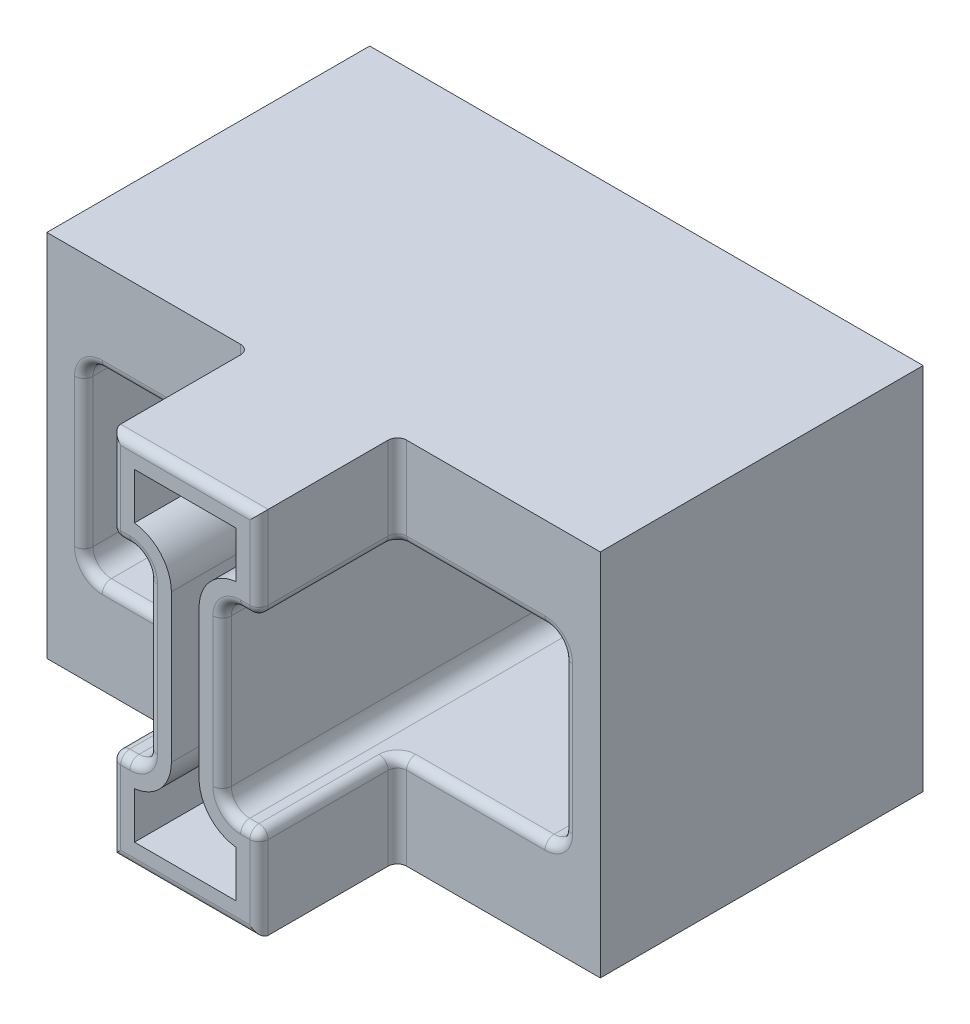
ISO-10303-21;
HEADER;
FILE_DESCRIPTION(('STEP AP214'),'2;1');
FILE_NAME('part.step','',(''),(''),'','','');
FILE_SCHEMA(('AUTOMOTIVE_DESIGN { 1 0 10303 214 1 1 1 1 }'));
ENDSEC;
DATA;
#1=APPLICATION_CONTEXT('core data for automotive mechanical design processes');
#2=APPLICATION_PROTOCOL_DEFINITION('international standard','automotive_design',2000,#1);
#3=PRODUCT_CONTEXT('',#1,'mechanical');
#4=PRODUCT('Part','Part','',(#3));
#5=PRODUCT_RELATED_PRODUCT_CATEGORY('part','',(#4));
#6=PRODUCT_DEFINITION_FORMATION('','',#4);
#7=PRODUCT_DEFINITION_CONTEXT('part definition',#1,'design');
#8=PRODUCT_DEFINITION('design','',#6,#7);
#9=PRODUCT_DEFINITION_SHAPE('','',#8);
#10=(LENGTH_UNIT() NAMED_UNIT(*) SI_UNIT(.MILLI.,.METRE.));
#11=(NAMED_UNIT(*) PLANE_ANGLE_UNIT() SI_UNIT($,.RADIAN.));
#12=(NAMED_UNIT(*) SI_UNIT($,.STERADIAN.) SOLID_ANGLE_UNIT());
#13=UNCERTAINTY_MEASURE_WITH_UNIT(LENGTH_MEASURE(1.E-05),#10,'distance_accuracy_value','');
#14=(GEOMETRIC_REPRESENTATION_CONTEXT(3) GLOBAL_UNCERTAINTY_ASSIGNED_CONTEXT((#13)) GLOBAL_UNIT_ASSIGNED_CONTEXT((#10,
#11,#12)) REPRESENTATION_CONTEXT('',''));
#15=CARTESIAN_POINT('',(0.,0.,0.));
#16=DIRECTION('',(0.,0.,1.));
#17=DIRECTION('',(1.,0.,0.));
#18=AXIS2_PLACEMENT_3D('',#15,#16,#17);
#19=CARTESIAN_POINT('',(27.94,63.5,63.5));
#20=DIRECTION('',(1.,0.,0.));
#21=DIRECTION('',(0.,0.,-1.));
#22=AXIS2_PLACEMENT_3D('',#19,#20,#21);
#23=PLANE('',#22);
#24=DIRECTION('',(0.,0.,1.));
#25=VECTOR('',#24,1.);
#26=CARTESIAN_POINT('',(27.94,39.37,63.5));
#27=LINE('',#26,#25);
#28=CARTESIAN_POINT('',(27.94,39.37,45.72));
#29=VERTEX_POINT('',#28);
#30=CARTESIAN_POINT('',(27.94,39.37,62.23));
#31=VERTEX_POINT('',#30);
#32=EDGE_CURVE('E840',#29,#31,#27,.T.);
#33=ORIENTED_EDGE('',*,*,#32,.T.);
#34=DIRECTION('',(0.,-1.,0.));
#35=VECTOR('',#34,1.);
#36=CARTESIAN_POINT('',(27.94,63.5,62.23));
#37=LINE('',#36,#35);
#38=CARTESIAN_POINT('',(27.94,50.8,62.23));
#39=VERTEX_POINT('',#38);
#40=EDGE_CURVE('E909',#31,#39,#37,.F.);
#41=ORIENTED_EDGE('',*,*,#40,.T.);
#42=DIRECTION('',(0.,0.,1.));
#43=VECTOR('',#42,1.);
#44=CARTESIAN_POINT('',(27.94,50.8,63.5));
#45=LINE('',#44,#43);
#46=CARTESIAN_POINT('',(27.94,50.8,45.72));
#47=VERTEX_POINT('',#46);
#48=EDGE_CURVE('E730',#47,#39,#45,.T.);
#49=ORIENTED_EDGE('',*,*,#48,.F.);
#50=DIRECTION('',(0.,-1.,0.));
#51=VECTOR('',#50,1.);
#52=CARTESIAN_POINT('',(27.94,38.1,45.72));
#53=LINE('',#52,#51);
#54=EDGE_CURVE('E838',#47,#29,#53,.T.);
#55=ORIENTED_EDGE('',*,*,#54,.T.);
#56=EDGE_LOOP('',(#33,#41,#49,#55));
#57=FACE_BOUND('',#56,.T.);
#58=ADVANCED_FACE('F33',(#57),#23,.F.);
#59=CARTESIAN_POINT('',(48.26,63.5,63.5));
#60=DIRECTION('',(-1.,0.,0.));
#61=DIRECTION('',(0.,0.,1.));
#62=AXIS2_PLACEMENT_3D('',#59,#60,#61);
#63=PLANE('',#62);
#64=DIRECTION('',(0.,0.,-1.));
#65=VECTOR('',#64,1.);
#66=CARTESIAN_POINT('',(48.26,50.8,63.5));
#67=LINE('',#66,#65);
#68=CARTESIAN_POINT('',(48.26,50.8,62.23));
#69=VERTEX_POINT('',#68);
#70=CARTESIAN_POINT('',(48.26,50.8,45.72));
#71=VERTEX_POINT('',#70);
#72=EDGE_CURVE('E740',#69,#71,#67,.T.);
#73=ORIENTED_EDGE('',*,*,#72,.F.);
#74=DIRECTION('',(0.,1.,0.));
#75=VECTOR('',#74,1.);
#76=CARTESIAN_POINT('',(48.26,63.5,62.23));
#77=LINE('',#76,#75);
#78=CARTESIAN_POINT('',(48.26,39.37,62.23));
#79=VERTEX_POINT('',#78);
#80=EDGE_CURVE('E913',#69,#79,#77,.F.);
#81=ORIENTED_EDGE('',*,*,#80,.T.);
#82=DIRECTION('',(0.,0.,-1.));
#83=VECTOR('',#82,1.);
#84=CARTESIAN_POINT('',(48.26,39.37,63.5));
#85=LINE('',#84,#83);
#86=CARTESIAN_POINT('',(48.26,39.37,45.72));
#87=VERTEX_POINT('',#86);
#88=EDGE_CURVE('E846',#79,#87,#85,.T.);
#89=ORIENTED_EDGE('',*,*,#88,.T.);
#90=DIRECTION('',(0.,-1.,0.));
#91=VECTOR('',#90,1.);
#92=CARTESIAN_POINT('',(48.26,50.8,45.72));
#93=LINE('',#92,#91);
#94=EDGE_CURVE('E843',#87,#71,#93,.F.);
#95=ORIENTED_EDGE('',*,*,#94,.T.);
#96=EDGE_LOOP('',(#73,#81,#89,#95));
#97=FACE_BOUND('',#96,.T.);
#98=ADVANCED_FACE('F1059',(#97),#63,.F.);
#99=CARTESIAN_POINT('',(0.,0.,63.5));
#100=DIRECTION('',(1.,0.,0.));
#101=DIRECTION('',(0.,0.,-1.));
#102=AXIS2_PLACEMENT_3D('',#99,#100,#101);
#103=PLANE('',#102);
#104=DIRECTION('',(0.,0.,-1.));
#105=VECTOR('',#104,1.);
#106=CARTESIAN_POINT('',(0.,0.,63.5));
#107=LINE('',#106,#105);
#108=CARTESIAN_POINT('',(0.,0.,44.45));
#109=VERTEX_POINT('',#108);
#110=CARTESIAN_POINT('',(0.,0.,0.));
#111=VERTEX_POINT('',#110);
#112=EDGE_CURVE('E760',#109,#111,#107,.T.);
#113=ORIENTED_EDGE('',*,*,#112,.F.);
#114=DIRECTION('',(0.,-1.,0.));
#115=VECTOR('',#114,1.);
#116=CARTESIAN_POINT('',(0.,63.5,44.45));
#117=LINE('',#116,#115);
#118=CARTESIAN_POINT('',(0.,50.8,44.45));
#119=VERTEX_POINT('',#118);
#120=EDGE_CURVE('E728',#119,#109,#117,.T.);
#121=ORIENTED_EDGE('',*,*,#120,.F.);
#122=DIRECTION('',(0.,0.,-1.));
#123=VECTOR('',#122,1.);
#124=CARTESIAN_POINT('',(0.,50.8,63.5));
#125=LINE('',#124,#123);
#126=CARTESIAN_POINT('',(0.,50.8,0.));
#127=VERTEX_POINT('',#126);
#128=EDGE_CURVE('E754',#119,#127,#125,.T.);
#129=ORIENTED_EDGE('',*,*,#128,.T.);
#130=DIRECTION('',(0.,-1.,0.));
#131=VECTOR('',#130,1.);
#132=CARTESIAN_POINT('',(0.,0.,0.));
#133=LINE('',#132,#131);
#134=EDGE_CURVE('E742',#127,#111,#133,.T.);
#135=ORIENTED_EDGE('',*,*,#134,.T.);
#136=EDGE_LOOP('',(#113,#121,#129,#135));
#137=FACE_BOUND('',#136,.T.);
#138=ADVANCED_FACE('F35',(#137),#103,.F.);
#139=CARTESIAN_POINT('',(0.,0.,63.5));
#140=DIRECTION('',(0.,1.,0.));
#141=DIRECTION('',(0.,0.,1.));
#142=AXIS2_PLACEMENT_3D('',#139,#140,#141);
#143=PLANE('',#142);
#144=DIRECTION('',(0.,0.,-1.));
#145=VECTOR('',#144,1.);
#146=CARTESIAN_POINT('',(48.26,0.,63.5));
#147=LINE('',#146,#145);
#148=CARTESIAN_POINT('',(48.26,0.,62.23));
#149=VERTEX_POINT('',#148);
#150=CARTESIAN_POINT('',(48.26,0.,45.72));
#151=VERTEX_POINT('',#150);
#152=EDGE_CURVE('E733',#149,#151,#147,.T.);
#153=ORIENTED_EDGE('',*,*,#152,.F.);
#154=DIRECTION('',(1.,0.,0.));
#155=VECTOR('',#154,1.);
#156=CARTESIAN_POINT('',(0.,0.,62.23));
#157=LINE('',#156,#155);
#158=CARTESIAN_POINT('',(27.94,0.,62.23));
#159=VERTEX_POINT('',#158);
#160=EDGE_CURVE('E931',#149,#159,#157,.F.);
#161=ORIENTED_EDGE('',*,*,#160,.T.);
#162=DIRECTION('',(0.,0.,1.));
#163=VECTOR('',#162,1.);
#164=CARTESIAN_POINT('',(27.94,0.,63.5));
#165=LINE('',#164,#163);
#166=CARTESIAN_POINT('',(27.94,0.,45.72));
#167=VERTEX_POINT('',#166);
#168=EDGE_CURVE('E725',#167,#159,#165,.T.);
#169=ORIENTED_EDGE('',*,*,#168,.F.);
#170=CARTESIAN_POINT('',(26.67,0.,45.72));
#171=DIRECTION('',(0.,1.,0.));
#172=DIRECTION('',(0.,0.,1.));
#173=AXIS2_PLACEMENT_3D('',#170,#171,#172);
#174=CIRCLE('',#173,1.27);
#175=CARTESIAN_POINT('',(26.67,0.,44.45));
#176=VERTEX_POINT('',#175);
#177=EDGE_CURVE('E861',#167,#176,#174,.T.);
#178=ORIENTED_EDGE('',*,*,#177,.T.);
#179=DIRECTION('',(1.,0.,0.));
#180=VECTOR('',#179,1.);
#181=CARTESIAN_POINT('',(0.,0.,44.45));
#182=LINE('',#181,#180);
#183=EDGE_CURVE('E709',#109,#176,#182,.T.);
#184=ORIENTED_EDGE('',*,*,#183,.F.);
#185=ORIENTED_EDGE('',*,*,#112,.T.);
#186=DIRECTION('',(1.,0.,0.));
#187=VECTOR('',#186,1.);
#188=CARTESIAN_POINT('',(0.,0.,0.));
#189=LINE('',#188,#187);
#190=CARTESIAN_POINT('',(76.2,0.,0.));
#191=VERTEX_POINT('',#190);
#192=EDGE_CURVE('E745',#111,#191,#189,.T.);
#193=ORIENTED_EDGE('',*,*,#192,.T.);
#194=DIRECTION('',(0.,0.,-1.));
#195=VECTOR('',#194,1.);
#196=CARTESIAN_POINT('',(76.2,0.,63.5));
#197=LINE('',#196,#195);
#198=CARTESIAN_POINT('',(76.2,0.,44.45));
#199=VERTEX_POINT('',#198);
#200=EDGE_CURVE('E758',#199,#191,#197,.T.);
#201=ORIENTED_EDGE('',*,*,#200,.F.);
#202=DIRECTION('',(1.,0.,0.));
#203=VECTOR('',#202,1.);
#204=CARTESIAN_POINT('',(76.2,0.,44.45));
#205=LINE('',#204,#203);
#206=CARTESIAN_POINT('',(49.53,0.,44.45));
#207=VERTEX_POINT('',#206);
#208=EDGE_CURVE('E735',#207,#199,#205,.T.);
#209=ORIENTED_EDGE('',*,*,#208,.F.);
#210=CARTESIAN_POINT('',(49.53,0.,45.72));
#211=DIRECTION('',(0.,1.,0.));
#212=DIRECTION('',(0.,0.,1.));
#213=AXIS2_PLACEMENT_3D('',#210,#211,#212);
#214=CIRCLE('',#213,1.27);
#215=EDGE_CURVE('E858',#207,#151,#214,.T.);
#216=ORIENTED_EDGE('',*,*,#215,.T.);
#217=EDGE_LOOP('',(#153,#161,#169,#178,#184,#185,#193,#201,#209,#216));
#218=FACE_BOUND('',#217,.T.);
#219=ADVANCED_FACE('F999',(#218),#143,.F.);
#220=CARTESIAN_POINT('',(76.2,0.,63.5));
#221=DIRECTION('',(-1.,0.,0.));
#222=DIRECTION('',(0.,0.,1.));
#223=AXIS2_PLACEMENT_3D('',#220,#221,#222);
#224=PLANE('',#223);
#225=DIRECTION('',(0.,0.,-1.));
#226=VECTOR('',#225,1.);
#227=CARTESIAN_POINT('',(76.2,50.8,63.5));
#228=LINE('',#227,#226);
#229=CARTESIAN_POINT('',(76.2,50.8,44.45));
#230=VERTEX_POINT('',#229);
#231=CARTESIAN_POINT('',(76.2,50.8,0.));
#232=VERTEX_POINT('',#231);
#233=EDGE_CURVE('E756',#230,#232,#228,.T.);
#234=ORIENTED_EDGE('',*,*,#233,.F.);
#235=DIRECTION('',(0.,-1.,0.));
#236=VECTOR('',#235,1.);
#237=CARTESIAN_POINT('',(76.2,63.5,44.45));
#238=LINE('',#237,#236);
#239=EDGE_CURVE('E737',#230,#199,#238,.T.);
#240=ORIENTED_EDGE('',*,*,#239,.T.);
#241=ORIENTED_EDGE('',*,*,#200,.T.);
#242=DIRECTION('',(0.,1.,0.));
#243=VECTOR('',#242,1.);
#244=CARTESIAN_POINT('',(76.2,0.,0.));
#245=LINE('',#244,#243);
#246=EDGE_CURVE('E748',#191,#232,#245,.T.);
#247=ORIENTED_EDGE('',*,*,#246,.T.);
#248=EDGE_LOOP('',(#234,#240,#241,#247));
#249=FACE_BOUND('',#248,.T.);
#250=ADVANCED_FACE('F1169',(#249),#224,.F.);
#251=CARTESIAN_POINT('',(0.,50.8,63.5));
#252=DIRECTION('',(0.,-1.,0.));
#253=DIRECTION('',(0.,0.,-1.));
#254=AXIS2_PLACEMENT_3D('',#251,#252,#253);
#255=PLANE('',#254);
#256=ORIENTED_EDGE('',*,*,#48,.T.);
#257=DIRECTION('',(-1.,0.,0.));
#258=VECTOR('',#257,1.);
#259=CARTESIAN_POINT('',(0.,50.8,62.23));
#260=LINE('',#259,#258);
#261=EDGE_CURVE('E911',#39,#69,#260,.F.);
#262=ORIENTED_EDGE('',*,*,#261,.T.);
#263=ORIENTED_EDGE('',*,*,#72,.T.);
#264=CARTESIAN_POINT('',(49.53,50.8,45.72));
#265=DIRECTION('',(0.,-1.,0.));
#266=DIRECTION('',(0.,0.,-1.));
#267=AXIS2_PLACEMENT_3D('',#264,#265,#266);
#268=CIRCLE('',#267,1.27);
#269=CARTESIAN_POINT('',(49.53,50.8,44.45));
#270=VERTEX_POINT('',#269);
#271=EDGE_CURVE('E856',#71,#270,#268,.T.);
#272=ORIENTED_EDGE('',*,*,#271,.T.);
#273=DIRECTION('',(1.,0.,0.));
#274=VECTOR('',#273,1.);
#275=CARTESIAN_POINT('',(0.,50.8,44.45));
#276=LINE('',#275,#274);
#277=EDGE_CURVE('E762',#270,#230,#276,.T.);
#278=ORIENTED_EDGE('',*,*,#277,.T.);
#279=ORIENTED_EDGE('',*,*,#233,.T.);
#280=DIRECTION('',(-1.,0.,0.));
#281=VECTOR('',#280,1.);
#282=CARTESIAN_POINT('',(0.,50.8,0.));
#283=LINE('',#282,#281);
#284=EDGE_CURVE('E751',#232,#127,#283,.T.);
#285=ORIENTED_EDGE('',*,*,#284,.T.);
#286=ORIENTED_EDGE('',*,*,#128,.F.);
#287=DIRECTION('',(1.,0.,0.));
#288=VECTOR('',#287,1.);
#289=CARTESIAN_POINT('',(0.,50.8,44.45));
#290=LINE('',#289,#288);
#291=CARTESIAN_POINT('',(26.67,50.8,44.45));
#292=VERTEX_POINT('',#291);
#293=EDGE_CURVE('E764',#119,#292,#290,.T.);
#294=ORIENTED_EDGE('',*,*,#293,.T.);
#295=CARTESIAN_POINT('',(26.67,50.8,45.72));
#296=DIRECTION('',(0.,-1.,0.));
#297=DIRECTION('',(0.,0.,-1.));
#298=AXIS2_PLACEMENT_3D('',#295,#296,#297);
#299=CIRCLE('',#298,1.27);
#300=EDGE_CURVE('E863',#292,#47,#299,.T.);
#301=ORIENTED_EDGE('',*,*,#300,.T.);
#302=EDGE_LOOP('',(#256,#262,#263,#272,#278,#279,#285,#286,#294,#301));
#303=FACE_BOUND('',#302,.T.);
#304=ADVANCED_FACE('F1056',(#303),#255,.F.);
#305=CARTESIAN_POINT('',(0.,50.8,63.5));
#306=DIRECTION('',(0.,0.,-1.));
#307=DIRECTION('',(-1.,0.,0.));
#308=AXIS2_PLACEMENT_3D('',#305,#306,#307);
#309=PLANE('',#308);
#310=CARTESIAN_POINT('',(30.48,35.56,63.5));
#311=DIRECTION('',(0.,0.,-1.));
#312=DIRECTION('',(1.,0.,0.));
#313=AXIS2_PLACEMENT_3D('',#310,#311,#312);
#314=CIRCLE('',#313,5.715);
#315=CARTESIAN_POINT('',(31.115,41.2396126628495,63.5));
#316=VERTEX_POINT('',#315);
#317=CARTESIAN_POINT('',(36.195,35.56,63.5));
#318=VERTEX_POINT('',#317);
#319=EDGE_CURVE('E48',#316,#318,#314,.T.);
#320=ORIENTED_EDGE('',*,*,#319,.F.);
#321=DIRECTION('',(0.,-1.,0.));
#322=VECTOR('',#321,1.);
#323=CARTESIAN_POINT('',(31.115,47.625,63.5));
#324=LINE('',#323,#322);
#325=CARTESIAN_POINT('',(31.115,47.625,63.5));
#326=VERTEX_POINT('',#325);
#327=EDGE_CURVE('E470',#326,#316,#324,.T.);
#328=ORIENTED_EDGE('',*,*,#327,.F.);
#329=DIRECTION('',(-1.,0.,0.));
#330=VECTOR('',#329,1.);
#331=CARTESIAN_POINT('',(45.085,47.625,63.5));
#332=LINE('',#331,#330);
#333=CARTESIAN_POINT('',(45.085,47.625,63.5));
#334=VERTEX_POINT('',#333);
#335=EDGE_CURVE('E467',#334,#326,#332,.T.);
#336=ORIENTED_EDGE('',*,*,#335,.F.);
#337=DIRECTION('',(0.,1.,0.));
#338=VECTOR('',#337,1.);
#339=CARTESIAN_POINT('',(45.085,41.2396126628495,63.5));
#340=LINE('',#339,#338);
#341=CARTESIAN_POINT('',(45.085,41.2396126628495,63.5));
#342=VERTEX_POINT('',#341);
#343=EDGE_CURVE('E464',#342,#334,#340,.T.);
#344=ORIENTED_EDGE('',*,*,#343,.F.);
#345=CARTESIAN_POINT('',(45.72,35.56,63.5));
#346=DIRECTION('',(0.,0.,-1.));
#347=DIRECTION('',(1.,0.,0.));
#348=AXIS2_PLACEMENT_3D('',#345,#346,#347);
#349=CIRCLE('',#348,5.715);
#350=CARTESIAN_POINT('',(40.005,35.56,63.5));
#351=VERTEX_POINT('',#350);
#352=EDGE_CURVE('E461',#351,#342,#349,.T.);
#353=ORIENTED_EDGE('',*,*,#352,.F.);
#354=DIRECTION('',(0.,1.,0.));
#355=VECTOR('',#354,1.);
#356=CARTESIAN_POINT('',(40.005,15.24,63.5));
#357=LINE('',#356,#355);
#358=CARTESIAN_POINT('',(40.005,15.24,63.5));
#359=VERTEX_POINT('',#358);
#360=EDGE_CURVE('E458',#359,#351,#357,.T.);
#361=ORIENTED_EDGE('',*,*,#360,.F.);
#362=CARTESIAN_POINT('',(45.72,15.24,63.5));
#363=DIRECTION('',(0.,0.,-1.));
#364=DIRECTION('',(1.,0.,0.));
#365=AXIS2_PLACEMENT_3D('',#362,#363,#364);
#366=CIRCLE('',#365,5.715);
#367=CARTESIAN_POINT('',(45.085,9.56038733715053,63.5));
#368=VERTEX_POINT('',#367);
#369=EDGE_CURVE('E455',#368,#359,#366,.T.);
#370=ORIENTED_EDGE('',*,*,#369,.F.);
#371=DIRECTION('',(0.,1.,0.));
#372=VECTOR('',#371,1.);
#373=CARTESIAN_POINT('',(45.085,3.175,63.5));
#374=LINE('',#373,#372);
#375=CARTESIAN_POINT('',(45.085,3.175,63.5));
#376=VERTEX_POINT('',#375);
#377=EDGE_CURVE('E452',#376,#368,#374,.T.);
#378=ORIENTED_EDGE('',*,*,#377,.F.);
#379=DIRECTION('',(1.,0.,0.));
#380=VECTOR('',#379,1.);
#381=CARTESIAN_POINT('',(31.115,3.175,63.5));
#382=LINE('',#381,#380);
#383=CARTESIAN_POINT('',(31.115,3.175,63.5));
#384=VERTEX_POINT('',#383);
#385=EDGE_CURVE('E446',#384,#376,#382,.T.);
#386=ORIENTED_EDGE('',*,*,#385,.F.);
#387=DIRECTION('',(0.,-1.,0.));
#388=VECTOR('',#387,1.);
#389=CARTESIAN_POINT('',(31.115,9.56038733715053,63.5));
#390=LINE('',#389,#388);
#391=CARTESIAN_POINT('',(31.115,9.56038733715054,63.5));
#392=VERTEX_POINT('',#391);
#393=EDGE_CURVE('E444',#392,#384,#390,.T.);
#394=ORIENTED_EDGE('',*,*,#393,.F.);
#395=CARTESIAN_POINT('',(30.48,15.24,63.5));
#396=DIRECTION('',(0.,0.,-1.));
#397=DIRECTION('',(1.,0.,0.));
#398=AXIS2_PLACEMENT_3D('',#395,#396,#397);
#399=CIRCLE('',#398,5.715);
#400=CARTESIAN_POINT('',(36.195,15.24,63.5));
#401=VERTEX_POINT('',#400);
#402=EDGE_CURVE('E425',#401,#392,#399,.T.);
#403=ORIENTED_EDGE('',*,*,#402,.F.);
#404=DIRECTION('',(0.,-1.,0.));
#405=VECTOR('',#404,1.);
#406=CARTESIAN_POINT('',(36.195,35.56,63.5));
#407=LINE('',#406,#405);
#408=EDGE_CURVE('E436',#318,#401,#407,.T.);
#409=ORIENTED_EDGE('',*,*,#408,.F.);
#410=EDGE_LOOP('',(#320,#328,#336,#344,#353,#361,#370,#378,#386,#394,#403,#409));
#411=FACE_BOUND('',#410,.T.);
#412=DIRECTION('',(0.,-1.,0.));
#413=VECTOR('',#412,1.);
#414=CARTESIAN_POINT('',(34.29,50.8,63.5));
#415=LINE('',#414,#413);
#416=CARTESIAN_POINT('',(34.29,35.56,63.5));
#417=VERTEX_POINT('',#416);
#418=CARTESIAN_POINT('',(34.29,15.24,63.5));
#419=VERTEX_POINT('',#418);
#420=EDGE_CURVE('E893',#417,#419,#415,.T.);
#421=ORIENTED_EDGE('',*,*,#420,.T.);
#422=CARTESIAN_POINT('',(30.48,15.24,63.5));
#423=DIRECTION('',(0.,0.,-1.));
#424=DIRECTION('',(-1.,0.,0.));
#425=AXIS2_PLACEMENT_3D('',#422,#423,#424);
#426=CIRCLE('',#425,3.81);
#427=CARTESIAN_POINT('',(30.48,11.43,63.5));
#428=VERTEX_POINT('',#427);
#429=EDGE_CURVE('E895',#419,#428,#426,.T.);
#430=ORIENTED_EDGE('',*,*,#429,.T.);
#431=DIRECTION('',(-1.,0.,0.));
#432=VECTOR('',#431,1.);
#433=CARTESIAN_POINT('',(0.,11.43,63.5));
#434=LINE('',#433,#432);
#435=CARTESIAN_POINT('',(29.21,11.43,63.5));
#436=VERTEX_POINT('',#435);
#437=EDGE_CURVE('E865',#428,#436,#434,.T.);
#438=ORIENTED_EDGE('',*,*,#437,.T.);
#439=DIRECTION('',(0.,-1.,0.));
#440=VECTOR('',#439,1.);
#441=CARTESIAN_POINT('',(29.21,50.8,63.5));
#442=LINE('',#441,#440);
#443=CARTESIAN_POINT('',(29.21,1.27,63.5));
#444=VERTEX_POINT('',#443);
#445=EDGE_CURVE('E867',#436,#444,#442,.T.);
#446=ORIENTED_EDGE('',*,*,#445,.T.);
#447=DIRECTION('',(1.,0.,0.));
#448=VECTOR('',#447,1.);
#449=CARTESIAN_POINT('',(0.,1.27,63.5));
#450=LINE('',#449,#448);
#451=CARTESIAN_POINT('',(46.99,1.27,63.5));
#452=VERTEX_POINT('',#451);
#453=EDGE_CURVE('E869',#444,#452,#450,.T.);
#454=ORIENTED_EDGE('',*,*,#453,.T.);
#455=DIRECTION('',(0.,1.,0.));
#456=VECTOR('',#455,1.);
#457=CARTESIAN_POINT('',(46.99,50.8,63.5));
#458=LINE('',#457,#456);
#459=CARTESIAN_POINT('',(46.99,11.43,63.5));
#460=VERTEX_POINT('',#459);
#461=EDGE_CURVE('E871',#452,#460,#458,.T.);
#462=ORIENTED_EDGE('',*,*,#461,.T.);
#463=DIRECTION('',(-1.,0.,0.));
#464=VECTOR('',#463,1.);
#465=CARTESIAN_POINT('',(0.,11.43,63.5));
#466=LINE('',#465,#464);
#467=CARTESIAN_POINT('',(45.72,11.43,63.5));
#468=VERTEX_POINT('',#467);
#469=EDGE_CURVE('E873',#460,#468,#466,.T.);
#470=ORIENTED_EDGE('',*,*,#469,.T.);
#471=CARTESIAN_POINT('',(45.72,15.24,63.5));
#472=DIRECTION('',(0.,0.,-1.));
#473=DIRECTION('',(-1.,0.,0.));
#474=AXIS2_PLACEMENT_3D('',#471,#472,#473);
#475=CIRCLE('',#474,3.81);
#476=CARTESIAN_POINT('',(41.91,15.24,63.5));
#477=VERTEX_POINT('',#476);
#478=EDGE_CURVE('E875',#468,#477,#475,.T.);
#479=ORIENTED_EDGE('',*,*,#478,.T.);
#480=DIRECTION('',(0.,1.,0.));
#481=VECTOR('',#480,1.);
#482=CARTESIAN_POINT('',(41.91,50.8,63.5));
#483=LINE('',#482,#481);
#484=CARTESIAN_POINT('',(41.91,35.56,63.5));
#485=VERTEX_POINT('',#484);
#486=EDGE_CURVE('E877',#477,#485,#483,.T.);
#487=ORIENTED_EDGE('',*,*,#486,.T.);
#488=CARTESIAN_POINT('',(45.72,35.56,63.5));
#489=DIRECTION('',(0.,0.,-1.));
#490=DIRECTION('',(-1.,0.,0.));
#491=AXIS2_PLACEMENT_3D('',#488,#489,#490);
#492=CIRCLE('',#491,3.81);
#493=CARTESIAN_POINT('',(45.72,39.37,63.5));
#494=VERTEX_POINT('',#493);
#495=EDGE_CURVE('E879',#485,#494,#492,.T.);
#496=ORIENTED_EDGE('',*,*,#495,.T.);
#497=DIRECTION('',(1.,0.,0.));
#498=VECTOR('',#497,1.);
#499=CARTESIAN_POINT('',(0.,39.37,63.5));
#500=LINE('',#499,#498);
#501=CARTESIAN_POINT('',(46.99,39.37,63.5));
#502=VERTEX_POINT('',#501);
#503=EDGE_CURVE('E881',#494,#502,#500,.T.);
#504=ORIENTED_EDGE('',*,*,#503,.T.);
#505=DIRECTION('',(0.,1.,0.));
#506=VECTOR('',#505,1.);
#507=CARTESIAN_POINT('',(46.99,50.8,63.5));
#508=LINE('',#507,#506);
#509=CARTESIAN_POINT('',(46.99,49.53,63.5));
#510=VERTEX_POINT('',#509);
#511=EDGE_CURVE('E883',#502,#510,#508,.T.);
#512=ORIENTED_EDGE('',*,*,#511,.T.);
#513=DIRECTION('',(-1.,0.,0.));
#514=VECTOR('',#513,1.);
#515=CARTESIAN_POINT('',(0.,49.53,63.5));
#516=LINE('',#515,#514);
#517=CARTESIAN_POINT('',(29.21,49.53,63.5));
#518=VERTEX_POINT('',#517);
#519=EDGE_CURVE('E885',#510,#518,#516,.T.);
#520=ORIENTED_EDGE('',*,*,#519,.T.);
#521=DIRECTION('',(0.,-1.,0.));
#522=VECTOR('',#521,1.);
#523=CARTESIAN_POINT('',(29.21,50.8,63.5));
#524=LINE('',#523,#522);
#525=CARTESIAN_POINT('',(29.21,39.37,63.5));
#526=VERTEX_POINT('',#525);
#527=EDGE_CURVE('E887',#518,#526,#524,.T.);
#528=ORIENTED_EDGE('',*,*,#527,.T.);
#529=DIRECTION('',(1.,0.,0.));
#530=VECTOR('',#529,1.);
#531=CARTESIAN_POINT('',(0.,39.37,63.5));
#532=LINE('',#531,#530);
#533=CARTESIAN_POINT('',(30.48,39.37,63.5));
#534=VERTEX_POINT('',#533);
#535=EDGE_CURVE('E889',#526,#534,#532,.T.);
#536=ORIENTED_EDGE('',*,*,#535,.T.);
#537=CARTESIAN_POINT('',(30.48,35.56,63.5));
#538=DIRECTION('',(0.,0.,-1.));
#539=DIRECTION('',(-1.,0.,0.));
#540=AXIS2_PLACEMENT_3D('',#537,#538,#539);
#541=CIRCLE('',#540,3.81);
#542=EDGE_CURVE('E891',#534,#417,#541,.T.);
#543=ORIENTED_EDGE('',*,*,#542,.T.);
#544=EDGE_LOOP('',(#421,#430,#438,#446,#454,#462,#470,#479,#487,#496,#504,#512,#520,#528,#536,#543));
#545=FACE_BOUND('',#544,.T.);
#546=ADVANCED_FACE('F440',(#411,#545),#309,.F.);
#547=CARTESIAN_POINT('',(0.,50.8,0.));
#548=DIRECTION('',(0.,0.,-1.));
#549=DIRECTION('',(-1.,0.,0.));
#550=AXIS2_PLACEMENT_3D('',#547,#548,#549);
#551=PLANE('',#550);
#552=DIRECTION('',(-1.,0.,0.));
#553=VECTOR('',#552,1.);
#554=CARTESIAN_POINT('',(45.085,47.625,0.));
#555=LINE('',#554,#553);
#556=CARTESIAN_POINT('',(45.085,47.625,0.));
#557=VERTEX_POINT('',#556);
#558=CARTESIAN_POINT('',(31.115,47.625,0.));
#559=VERTEX_POINT('',#558);
#560=EDGE_CURVE('E498',#557,#559,#555,.T.);
#561=ORIENTED_EDGE('',*,*,#560,.T.);
#562=DIRECTION('',(0.,-1.,0.));
#563=VECTOR('',#562,1.);
#564=CARTESIAN_POINT('',(31.115,47.625,0.));
#565=LINE('',#564,#563);
#566=CARTESIAN_POINT('',(31.115,41.2396126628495,0.));
#567=VERTEX_POINT('',#566);
#568=EDGE_CURVE('E501',#559,#567,#565,.T.);
#569=ORIENTED_EDGE('',*,*,#568,.T.);
#570=CARTESIAN_POINT('',(30.48,35.56,0.));
#571=DIRECTION('',(0.,0.,-1.));
#572=DIRECTION('',(1.,0.,0.));
#573=AXIS2_PLACEMENT_3D('',#570,#571,#572);
#574=CIRCLE('',#573,5.715);
#575=CARTESIAN_POINT('',(36.195,35.56,0.));
#576=VERTEX_POINT('',#575);
#577=EDGE_CURVE('E473',#567,#576,#574,.T.);
#578=ORIENTED_EDGE('',*,*,#577,.T.);
#579=DIRECTION('',(0.,-1.,0.));
#580=VECTOR('',#579,1.);
#581=CARTESIAN_POINT('',(36.195,35.56,0.));
#582=LINE('',#581,#580);
#583=CARTESIAN_POINT('',(36.195,15.24,0.));
#584=VERTEX_POINT('',#583);
#585=EDGE_CURVE('E476',#576,#584,#582,.T.);
#586=ORIENTED_EDGE('',*,*,#585,.T.);
#587=CARTESIAN_POINT('',(30.48,15.24,0.));
#588=DIRECTION('',(0.,0.,-1.));
#589=DIRECTION('',(1.,0.,0.));
#590=AXIS2_PLACEMENT_3D('',#587,#588,#589);
#591=CIRCLE('',#590,5.715);
#592=CARTESIAN_POINT('',(31.115,9.56038733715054,0.));
#593=VERTEX_POINT('',#592);
#594=EDGE_CURVE('E428',#584,#593,#591,.T.);
#595=ORIENTED_EDGE('',*,*,#594,.T.);
#596=DIRECTION('',(0.,-1.,0.));
#597=VECTOR('',#596,1.);
#598=CARTESIAN_POINT('',(31.115,9.56038733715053,0.));
#599=LINE('',#598,#597);
#600=CARTESIAN_POINT('',(31.115,3.175,0.));
#601=VERTEX_POINT('',#600);
#602=EDGE_CURVE('E56',#593,#601,#599,.T.);
#603=ORIENTED_EDGE('',*,*,#602,.T.);
#604=DIRECTION('',(1.,0.,0.));
#605=VECTOR('',#604,1.);
#606=CARTESIAN_POINT('',(31.115,3.175,0.));
#607=LINE('',#606,#605);
#608=CARTESIAN_POINT('',(45.085,3.175,0.));
#609=VERTEX_POINT('',#608);
#610=EDGE_CURVE('E480',#601,#609,#607,.T.);
#611=ORIENTED_EDGE('',*,*,#610,.T.);
#612=DIRECTION('',(0.,1.,0.));
#613=VECTOR('',#612,1.);
#614=CARTESIAN_POINT('',(45.085,3.175,0.));
#615=LINE('',#614,#613);
#616=CARTESIAN_POINT('',(45.085,9.56038733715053,0.));
#617=VERTEX_POINT('',#616);
#618=EDGE_CURVE('E483',#609,#617,#615,.T.);
#619=ORIENTED_EDGE('',*,*,#618,.T.);
#620=CARTESIAN_POINT('',(45.72,15.24,0.));
#621=DIRECTION('',(0.,0.,-1.));
#622=DIRECTION('',(1.,0.,0.));
#623=AXIS2_PLACEMENT_3D('',#620,#621,#622);
#624=CIRCLE('',#623,5.715);
#625=CARTESIAN_POINT('',(40.005,15.24,0.));
#626=VERTEX_POINT('',#625);
#627=EDGE_CURVE('E486',#617,#626,#624,.T.);
#628=ORIENTED_EDGE('',*,*,#627,.T.);
#629=DIRECTION('',(0.,1.,0.));
#630=VECTOR('',#629,1.);
#631=CARTESIAN_POINT('',(40.005,15.24,0.));
#632=LINE('',#631,#630);
#633=CARTESIAN_POINT('',(40.005,35.56,0.));
#634=VERTEX_POINT('',#633);
#635=EDGE_CURVE('E489',#626,#634,#632,.T.);
#636=ORIENTED_EDGE('',*,*,#635,.T.);
#637=CARTESIAN_POINT('',(45.72,35.56,0.));
#638=DIRECTION('',(0.,0.,-1.));
#639=DIRECTION('',(1.,0.,0.));
#640=AXIS2_PLACEMENT_3D('',#637,#638,#639);
#641=CIRCLE('',#640,5.715);
#642=CARTESIAN_POINT('',(45.085,41.2396126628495,0.));
#643=VERTEX_POINT('',#642);
#644=EDGE_CURVE('E492',#634,#643,#641,.T.);
#645=ORIENTED_EDGE('',*,*,#644,.T.);
#646=DIRECTION('',(0.,1.,0.));
#647=VECTOR('',#646,1.);
#648=CARTESIAN_POINT('',(45.085,41.2396126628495,0.));
#649=LINE('',#648,#647);
#650=EDGE_CURVE('E495',#643,#557,#649,.T.);
#651=ORIENTED_EDGE('',*,*,#650,.T.);
#652=EDGE_LOOP('',(#561,#569,#578,#586,#595,#603,#611,#619,#628,#636,#645,#651));
#653=FACE_BOUND('',#652,.T.);
#654=CARTESIAN_POINT('',(30.48,15.24,0.));
#655=DIRECTION('',(0.,0.,-1.));
#656=DIRECTION('',(1.,0.,0.));
#657=AXIS2_PLACEMENT_3D('',#654,#655,#656);
#658=CIRCLE('',#657,2.54);
#659=CARTESIAN_POINT('',(33.02,15.24,0.));
#660=VERTEX_POINT('',#659);
#661=CARTESIAN_POINT('',(30.48,12.7,0.));
#662=VERTEX_POINT('',#661);
#663=EDGE_CURVE('E642',#660,#662,#658,.T.);
#664=ORIENTED_EDGE('',*,*,#663,.F.);
#665=DIRECTION('',(0.,-1.,0.));
#666=VECTOR('',#665,1.);
#667=CARTESIAN_POINT('',(33.02,15.24,0.));
#668=LINE('',#667,#666);
#669=CARTESIAN_POINT('',(33.02,35.56,0.));
#670=VERTEX_POINT('',#669);
#671=EDGE_CURVE('E663',#670,#660,#668,.T.);
#672=ORIENTED_EDGE('',*,*,#671,.F.);
#673=CARTESIAN_POINT('',(30.48,35.56,0.));
#674=DIRECTION('',(0.,0.,-1.));
#675=DIRECTION('',(-1.,0.,0.));
#676=AXIS2_PLACEMENT_3D('',#673,#674,#675);
#677=CIRCLE('',#676,2.54);
#678=CARTESIAN_POINT('',(30.48,38.1,0.));
#679=VERTEX_POINT('',#678);
#680=EDGE_CURVE('E660',#679,#670,#677,.T.);
#681=ORIENTED_EDGE('',*,*,#680,.F.);
#682=DIRECTION('',(1.,0.,0.));
#683=VECTOR('',#682,1.);
#684=CARTESIAN_POINT('',(7.62000000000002,38.1,0.));
#685=LINE('',#684,#683);
#686=CARTESIAN_POINT('',(7.62000000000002,38.1,0.));
#687=VERTEX_POINT('',#686);
#688=EDGE_CURVE('E657',#687,#679,#685,.T.);
#689=ORIENTED_EDGE('',*,*,#688,.F.);
#690=CARTESIAN_POINT('',(7.62,35.56,0.));
#691=DIRECTION('',(0.,0.,-1.));
#692=DIRECTION('',(-1.,0.,0.));
#693=AXIS2_PLACEMENT_3D('',#690,#691,#692);
#694=CIRCLE('',#693,2.54);
#695=CARTESIAN_POINT('',(5.08,35.56,0.));
#696=VERTEX_POINT('',#695);
#697=EDGE_CURVE('E654',#696,#687,#694,.T.);
#698=ORIENTED_EDGE('',*,*,#697,.F.);
#699=DIRECTION('',(0.,1.,0.));
#700=VECTOR('',#699,1.);
#701=CARTESIAN_POINT('',(5.08,15.24,0.));
#702=LINE('',#701,#700);
#703=CARTESIAN_POINT('',(5.08,15.24,0.));
#704=VERTEX_POINT('',#703);
#705=EDGE_CURVE('E651',#704,#696,#702,.T.);
#706=ORIENTED_EDGE('',*,*,#705,.F.);
#707=CARTESIAN_POINT('',(7.62,15.24,0.));
#708=DIRECTION('',(0.,0.,-1.));
#709=DIRECTION('',(-1.,0.,0.));
#710=AXIS2_PLACEMENT_3D('',#707,#708,#709);
#711=CIRCLE('',#710,2.54);
#712=CARTESIAN_POINT('',(7.62000000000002,12.7,0.));
#713=VERTEX_POINT('',#712);
#714=EDGE_CURVE('E648',#713,#704,#711,.T.);
#715=ORIENTED_EDGE('',*,*,#714,.F.);
#716=DIRECTION('',(-1.,0.,0.));
#717=VECTOR('',#716,1.);
#718=CARTESIAN_POINT('',(7.62000000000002,12.7,0.));
#719=LINE('',#718,#717);
#720=EDGE_CURVE('E645',#662,#713,#719,.T.);
#721=ORIENTED_EDGE('',*,*,#720,.F.);
#722=EDGE_LOOP('',(#664,#672,#681,#689,#698,#706,#715,#721));
#723=FACE_BOUND('',#722,.T.);
#724=CARTESIAN_POINT('',(68.58,15.24,0.));
#725=DIRECTION('',(0.,0.,-1.));
#726=DIRECTION('',(1.,0.,0.));
#727=AXIS2_PLACEMENT_3D('',#724,#725,#726);
#728=CIRCLE('',#727,2.54);
#729=CARTESIAN_POINT('',(71.12,15.24,0.));
#730=VERTEX_POINT('',#729);
#731=CARTESIAN_POINT('',(68.58,12.7,0.));
#732=VERTEX_POINT('',#731);
#733=EDGE_CURVE('E669',#730,#732,#728,.T.);
#734=ORIENTED_EDGE('',*,*,#733,.F.);
#735=DIRECTION('',(0.,-1.,0.));
#736=VECTOR('',#735,1.);
#737=CARTESIAN_POINT('',(71.12,15.24,0.));
#738=LINE('',#737,#736);
#739=CARTESIAN_POINT('',(71.12,35.56,0.));
#740=VERTEX_POINT('',#739);
#741=EDGE_CURVE('E703',#740,#730,#738,.T.);
#742=ORIENTED_EDGE('',*,*,#741,.F.);
#743=CARTESIAN_POINT('',(68.58,35.56,0.));
#744=DIRECTION('',(0.,0.,-1.));
#745=DIRECTION('',(-1.,0.,0.));
#746=AXIS2_PLACEMENT_3D('',#743,#744,#745);
#747=CIRCLE('',#746,2.54);
#748=CARTESIAN_POINT('',(68.58,38.1,0.));
#749=VERTEX_POINT('',#748);
#750=EDGE_CURVE('E700',#749,#740,#747,.T.);
#751=ORIENTED_EDGE('',*,*,#750,.F.);
#752=DIRECTION('',(1.,0.,0.));
#753=VECTOR('',#752,1.);
#754=CARTESIAN_POINT('',(45.72,38.1,0.));
#755=LINE('',#754,#753);
#756=CARTESIAN_POINT('',(45.72,38.1,0.));
#757=VERTEX_POINT('',#756);
#758=EDGE_CURVE('E697',#757,#749,#755,.T.);
#759=ORIENTED_EDGE('',*,*,#758,.F.);
#760=CARTESIAN_POINT('',(45.72,35.56,0.));
#761=DIRECTION('',(0.,0.,-1.));
#762=DIRECTION('',(-1.,0.,0.));
#763=AXIS2_PLACEMENT_3D('',#760,#761,#762);
#764=CIRCLE('',#763,2.54);
#765=CARTESIAN_POINT('',(43.18,35.56,0.));
#766=VERTEX_POINT('',#765);
#767=EDGE_CURVE('E694',#766,#757,#764,.T.);
#768=ORIENTED_EDGE('',*,*,#767,.F.);
#769=DIRECTION('',(0.,1.,0.));
#770=VECTOR('',#769,1.);
#771=CARTESIAN_POINT('',(43.18,15.24,0.));
#772=LINE('',#771,#770);
#773=CARTESIAN_POINT('',(43.18,15.24,0.));
#774=VERTEX_POINT('',#773);
#775=EDGE_CURVE('E691',#774,#766,#772,.T.);
#776=ORIENTED_EDGE('',*,*,#775,.F.);
#777=CARTESIAN_POINT('',(45.72,15.24,0.));
#778=DIRECTION('',(0.,0.,-1.));
#779=DIRECTION('',(-1.,0.,0.));
#780=AXIS2_PLACEMENT_3D('',#777,#778,#779);
#781=CIRCLE('',#780,2.54);
#782=CARTESIAN_POINT('',(45.72,12.7,0.));
#783=VERTEX_POINT('',#782);
#784=EDGE_CURVE('E688',#783,#774,#781,.T.);
#785=ORIENTED_EDGE('',*,*,#784,.F.);
#786=DIRECTION('',(-1.,0.,0.));
#787=VECTOR('',#786,1.);
#788=CARTESIAN_POINT('',(45.72,12.7,0.));
#789=LINE('',#788,#787);
#790=EDGE_CURVE('E685',#732,#783,#789,.T.);
#791=ORIENTED_EDGE('',*,*,#790,.F.);
#792=EDGE_LOOP('',(#734,#742,#751,#759,#768,#776,#785,#791));
#793=FACE_BOUND('',#792,.T.);
#794=ORIENTED_EDGE('',*,*,#134,.F.);
#795=ORIENTED_EDGE('',*,*,#284,.F.);
#796=ORIENTED_EDGE('',*,*,#246,.F.);
#797=ORIENTED_EDGE('',*,*,#192,.F.);
#798=EDGE_LOOP('',(#794,#795,#796,#797));
#799=FACE_BOUND('',#798,.T.);
#800=ADVANCED_FACE('F969',(#653,#723,#793,#799),#551,.T.);
#801=CARTESIAN_POINT('',(76.2,63.5,44.45));
#802=DIRECTION('',(0.,0.,-1.));
#803=DIRECTION('',(-1.,0.,0.));
#804=AXIS2_PLACEMENT_3D('',#801,#802,#803);
#805=PLANE('',#804);
#806=ORIENTED_EDGE('',*,*,#277,.F.);
#807=DIRECTION('',(0.,-1.,0.));
#808=VECTOR('',#807,1.);
#809=CARTESIAN_POINT('',(49.53,38.1,44.45));
#810=LINE('',#809,#808);
#811=CARTESIAN_POINT('',(49.53,39.37,44.45));
#812=VERTEX_POINT('',#811);
#813=EDGE_CURVE('E823',#270,#812,#810,.T.);
#814=ORIENTED_EDGE('',*,*,#813,.T.);
#815=DIRECTION('',(1.,0.,0.));
#816=VECTOR('',#815,1.);
#817=CARTESIAN_POINT('',(76.2,39.37,44.45));
#818=LINE('',#817,#816);
#819=CARTESIAN_POINT('',(68.58,39.37,44.45));
#820=VERTEX_POINT('',#819);
#821=EDGE_CURVE('E821',#812,#820,#818,.T.);
#822=ORIENTED_EDGE('',*,*,#821,.T.);
#823=CARTESIAN_POINT('',(68.58,35.56,44.45));
#824=DIRECTION('',(0.,0.,-1.));
#825=DIRECTION('',(-1.,0.,0.));
#826=AXIS2_PLACEMENT_3D('',#823,#824,#825);
#827=CIRCLE('',#826,3.81);
#828=CARTESIAN_POINT('',(72.39,35.56,44.45));
#829=VERTEX_POINT('',#828);
#830=EDGE_CURVE('E819',#820,#829,#827,.T.);
#831=ORIENTED_EDGE('',*,*,#830,.T.);
#832=DIRECTION('',(0.,-1.,0.));
#833=VECTOR('',#832,1.);
#834=CARTESIAN_POINT('',(72.39,63.5,44.45));
#835=LINE('',#834,#833);
#836=CARTESIAN_POINT('',(72.39,15.24,44.45));
#837=VERTEX_POINT('',#836);
#838=EDGE_CURVE('E817',#829,#837,#835,.T.);
#839=ORIENTED_EDGE('',*,*,#838,.T.);
#840=CARTESIAN_POINT('',(68.58,15.24,44.45));
#841=DIRECTION('',(0.,0.,-1.));
#842=DIRECTION('',(-1.,0.,0.));
#843=AXIS2_PLACEMENT_3D('',#840,#841,#842);
#844=CIRCLE('',#843,3.81);
#845=CARTESIAN_POINT('',(68.58,11.43,44.45));
#846=VERTEX_POINT('',#845);
#847=EDGE_CURVE('E815',#837,#846,#844,.T.);
#848=ORIENTED_EDGE('',*,*,#847,.T.);
#849=DIRECTION('',(-1.,0.,0.));
#850=VECTOR('',#849,1.);
#851=CARTESIAN_POINT('',(76.2,11.43,44.45));
#852=LINE('',#851,#850);
#853=CARTESIAN_POINT('',(49.53,11.43,44.45));
#854=VERTEX_POINT('',#853);
#855=EDGE_CURVE('E813',#846,#854,#852,.T.);
#856=ORIENTED_EDGE('',*,*,#855,.T.);
#857=DIRECTION('',(0.,-1.,0.));
#858=VECTOR('',#857,1.);
#859=CARTESIAN_POINT('',(49.53,0.,44.45));
#860=LINE('',#859,#858);
#861=EDGE_CURVE('E811',#854,#207,#860,.T.);
#862=ORIENTED_EDGE('',*,*,#861,.T.);
#863=ORIENTED_EDGE('',*,*,#208,.T.);
#864=ORIENTED_EDGE('',*,*,#239,.F.);
#865=EDGE_LOOP('',(#806,#814,#822,#831,#839,#848,#856,#862,#863,#864));
#866=FACE_BOUND('',#865,.T.);
#867=ADVANCED_FACE('F1119',(#866),#805,.F.);
#868=DIRECTION('',(0.,0.,1.));
#869=VECTOR('',#868,1.);
#870=CARTESIAN_POINT('',(48.26,11.43,63.5));
#871=LINE('',#870,#869);
#872=CARTESIAN_POINT('',(48.26,11.43,45.72));
#873=VERTEX_POINT('',#872);
#874=CARTESIAN_POINT('',(48.26,11.43,62.23));
#875=VERTEX_POINT('',#874);
#876=EDGE_CURVE('E781',#873,#875,#871,.T.);
#877=ORIENTED_EDGE('',*,*,#876,.T.);
#878=DIRECTION('',(0.,1.,0.));
#879=VECTOR('',#878,1.);
#880=CARTESIAN_POINT('',(48.26,63.5,62.23));
#881=LINE('',#880,#879);
#882=EDGE_CURVE('E929',#875,#149,#881,.F.);
#883=ORIENTED_EDGE('',*,*,#882,.T.);
#884=ORIENTED_EDGE('',*,*,#152,.T.);
#885=DIRECTION('',(0.,-1.,0.));
#886=VECTOR('',#885,1.);
#887=CARTESIAN_POINT('',(48.26,12.7,45.72));
#888=LINE('',#887,#886);
#889=EDGE_CURVE('E779',#151,#873,#888,.F.);
#890=ORIENTED_EDGE('',*,*,#889,.T.);
#891=EDGE_LOOP('',(#877,#883,#884,#890));
#892=FACE_BOUND('',#891,.T.);
#893=ADVANCED_FACE('F1142',(#892),#63,.F.);
#894=CARTESIAN_POINT('',(0.,63.5,44.45));
#895=DIRECTION('',(0.,0.,-1.));
#896=DIRECTION('',(-1.,0.,0.));
#897=AXIS2_PLACEMENT_3D('',#894,#895,#896);
#898=PLANE('',#897);
#899=ORIENTED_EDGE('',*,*,#183,.T.);
#900=DIRECTION('',(0.,-1.,0.));
#901=VECTOR('',#900,1.);
#902=CARTESIAN_POINT('',(26.67,12.7,44.45));
#903=LINE('',#902,#901);
#904=CARTESIAN_POINT('',(26.67,11.43,44.45));
#905=VERTEX_POINT('',#904);
#906=EDGE_CURVE('E803',#176,#905,#903,.F.);
#907=ORIENTED_EDGE('',*,*,#906,.T.);
#908=DIRECTION('',(-1.,0.,0.));
#909=VECTOR('',#908,1.);
#910=CARTESIAN_POINT('',(0.,11.43,44.45));
#911=LINE('',#910,#909);
#912=CARTESIAN_POINT('',(7.62000000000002,11.43,44.45));
#913=VERTEX_POINT('',#912);
#914=EDGE_CURVE('E801',#905,#913,#911,.T.);
#915=ORIENTED_EDGE('',*,*,#914,.T.);
#916=CARTESIAN_POINT('',(7.62,15.24,44.45));
#917=DIRECTION('',(0.,0.,-1.));
#918=DIRECTION('',(-1.,0.,0.));
#919=AXIS2_PLACEMENT_3D('',#916,#917,#918);
#920=CIRCLE('',#919,3.81);
#921=CARTESIAN_POINT('',(3.81,15.24,44.45));
#922=VERTEX_POINT('',#921);
#923=EDGE_CURVE('E799',#913,#922,#920,.T.);
#924=ORIENTED_EDGE('',*,*,#923,.T.);
#925=DIRECTION('',(0.,1.,0.));
#926=VECTOR('',#925,1.);
#927=CARTESIAN_POINT('',(3.81,63.5,44.45));
#928=LINE('',#927,#926);
#929=CARTESIAN_POINT('',(3.81,35.56,44.45));
#930=VERTEX_POINT('',#929);
#931=EDGE_CURVE('E797',#922,#930,#928,.T.);
#932=ORIENTED_EDGE('',*,*,#931,.T.);
#933=CARTESIAN_POINT('',(7.62,35.56,44.45));
#934=DIRECTION('',(0.,0.,-1.));
#935=DIRECTION('',(-1.,0.,0.));
#936=AXIS2_PLACEMENT_3D('',#933,#934,#935);
#937=CIRCLE('',#936,3.81);
#938=CARTESIAN_POINT('',(7.62000000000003,39.37,44.45));
#939=VERTEX_POINT('',#938);
#940=EDGE_CURVE('E795',#930,#939,#937,.T.);
#941=ORIENTED_EDGE('',*,*,#940,.T.);
#942=DIRECTION('',(1.,0.,0.));
#943=VECTOR('',#942,1.);
#944=CARTESIAN_POINT('',(0.,39.37,44.45));
#945=LINE('',#944,#943);
#946=CARTESIAN_POINT('',(26.67,39.37,44.45));
#947=VERTEX_POINT('',#946);
#948=EDGE_CURVE('E793',#939,#947,#945,.T.);
#949=ORIENTED_EDGE('',*,*,#948,.T.);
#950=DIRECTION('',(0.,-1.,0.));
#951=VECTOR('',#950,1.);
#952=CARTESIAN_POINT('',(26.67,50.8,44.45));
#953=LINE('',#952,#951);
#954=EDGE_CURVE('E791',#947,#292,#953,.F.);
#955=ORIENTED_EDGE('',*,*,#954,.T.);
#956=ORIENTED_EDGE('',*,*,#293,.F.);
#957=ORIENTED_EDGE('',*,*,#120,.T.);
#958=EDGE_LOOP('',(#899,#907,#915,#924,#932,#941,#949,#955,#956,#957));
#959=FACE_BOUND('',#958,.T.);
#960=ADVANCED_FACE('F1147',(#959),#898,.F.);
#961=ORIENTED_EDGE('',*,*,#168,.T.);
#962=DIRECTION('',(0.,-1.,0.));
#963=VECTOR('',#962,1.);
#964=CARTESIAN_POINT('',(27.94,63.5,62.23));
#965=LINE('',#964,#963);
#966=CARTESIAN_POINT('',(27.94,11.43,62.23));
#967=VERTEX_POINT('',#966);
#968=EDGE_CURVE('E933',#159,#967,#965,.F.);
#969=ORIENTED_EDGE('',*,*,#968,.T.);
#970=DIRECTION('',(0.,0.,-1.));
#971=VECTOR('',#970,1.);
#972=CARTESIAN_POINT('',(27.94,11.43,63.5));
#973=LINE('',#972,#971);
#974=CARTESIAN_POINT('',(27.94,11.43,45.72));
#975=VERTEX_POINT('',#974);
#976=EDGE_CURVE('E769',#967,#975,#973,.T.);
#977=ORIENTED_EDGE('',*,*,#976,.T.);
#978=DIRECTION('',(0.,-1.,0.));
#979=VECTOR('',#978,1.);
#980=CARTESIAN_POINT('',(27.94,0.,45.72));
#981=LINE('',#980,#979);
#982=EDGE_CURVE('E767',#975,#167,#981,.T.);
#983=ORIENTED_EDGE('',*,*,#982,.T.);
#984=EDGE_LOOP('',(#961,#969,#977,#983));
#985=FACE_BOUND('',#984,.T.);
#986=ADVANCED_FACE('F995',(#985),#23,.F.);
#987=CARTESIAN_POINT('',(68.58,15.24,63.5));
#988=DIRECTION('',(0.,0.,-1.));
#989=DIRECTION('',(-1.,0.,0.));
#990=AXIS2_PLACEMENT_3D('',#987,#988,#989);
#991=CYLINDRICAL_SURFACE('',#990,2.54);
#992=DIRECTION('',(0.,0.,-1.));
#993=VECTOR('',#992,1.);
#994=CARTESIAN_POINT('',(68.58,12.7,63.5));
#995=LINE('',#994,#993);
#996=CARTESIAN_POINT('',(68.58,12.7,43.18));
#997=VERTEX_POINT('',#996);
#998=EDGE_CURVE('E706',#997,#732,#995,.T.);
#999=ORIENTED_EDGE('',*,*,#998,.F.);
#1000=CARTESIAN_POINT('',(68.58,15.24,43.18));
#1001=DIRECTION('',(0.,0.,-1.));
#1002=DIRECTION('',(-1.,0.,0.));
#1003=AXIS2_PLACEMENT_3D('',#1000,#1001,#1002);
#1004=CIRCLE('',#1003,2.54);
#1005=CARTESIAN_POINT('',(71.12,15.24,43.18));
#1006=VERTEX_POINT('',#1005);
#1007=EDGE_CURVE('E825',#997,#1006,#1004,.F.);
#1008=ORIENTED_EDGE('',*,*,#1007,.T.);
#1009=DIRECTION('',(0.,0.,-1.));
#1010=VECTOR('',#1009,1.);
#1011=CARTESIAN_POINT('',(71.12,15.24,63.5));
#1012=LINE('',#1011,#1010);
#1013=EDGE_CURVE('E707',#1006,#730,#1012,.T.);
#1014=ORIENTED_EDGE('',*,*,#1013,.T.);
#1015=ORIENTED_EDGE('',*,*,#733,.T.);
#1016=EDGE_LOOP('',(#999,#1008,#1014,#1015));
#1017=FACE_BOUND('',#1016,.T.);
#1018=ADVANCED_FACE('F1146',(#1017),#991,.F.);
#1019=CARTESIAN_POINT('',(71.12,15.24,63.5));
#1020=DIRECTION('',(1.,0.,0.));
#1021=DIRECTION('',(0.,0.,-1.));
#1022=AXIS2_PLACEMENT_3D('',#1019,#1020,#1021);
#1023=PLANE('',#1022);
#1024=ORIENTED_EDGE('',*,*,#1013,.F.);
#1025=DIRECTION('',(0.,-1.,0.));
#1026=VECTOR('',#1025,1.);
#1027=CARTESIAN_POINT('',(71.12,15.24,43.18));
#1028=LINE('',#1027,#1026);
#1029=CARTESIAN_POINT('',(71.12,35.56,43.18));
#1030=VERTEX_POINT('',#1029);
#1031=EDGE_CURVE('E827',#1006,#1030,#1028,.F.);
#1032=ORIENTED_EDGE('',*,*,#1031,.T.);
#1033=DIRECTION('',(0.,0.,-1.));
#1034=VECTOR('',#1033,1.);
#1035=CARTESIAN_POINT('',(71.12,35.56,63.5));
#1036=LINE('',#1035,#1034);
#1037=EDGE_CURVE('E710',#1030,#740,#1036,.T.);
#1038=ORIENTED_EDGE('',*,*,#1037,.T.);
#1039=ORIENTED_EDGE('',*,*,#741,.T.);
#1040=EDGE_LOOP('',(#1024,#1032,#1038,#1039));
#1041=FACE_BOUND('',#1040,.T.);
#1042=ADVANCED_FACE('F1152',(#1041),#1023,.F.);
#1043=CARTESIAN_POINT('',(68.58,35.56,63.5));
#1044=DIRECTION('',(0.,0.,-1.));
#1045=DIRECTION('',(-1.,0.,0.));
#1046=AXIS2_PLACEMENT_3D('',#1043,#1044,#1045);
#1047=CYLINDRICAL_SURFACE('',#1046,2.54);
#1048=ORIENTED_EDGE('',*,*,#1037,.F.);
#1049=CARTESIAN_POINT('',(68.58,35.56,43.18));
#1050=DIRECTION('',(0.,0.,-1.));
#1051=DIRECTION('',(-1.,0.,0.));
#1052=AXIS2_PLACEMENT_3D('',#1049,#1050,#1051);
#1053=CIRCLE('',#1052,2.54);
#1054=CARTESIAN_POINT('',(68.58,38.1,43.18));
#1055=VERTEX_POINT('',#1054);
#1056=EDGE_CURVE('E829',#1030,#1055,#1053,.F.);
#1057=ORIENTED_EDGE('',*,*,#1056,.T.);
#1058=DIRECTION('',(0.,0.,-1.));
#1059=VECTOR('',#1058,1.);
#1060=CARTESIAN_POINT('',(68.58,38.1,63.5));
#1061=LINE('',#1060,#1059);
#1062=EDGE_CURVE('E712',#1055,#749,#1061,.T.);
#1063=ORIENTED_EDGE('',*,*,#1062,.T.);
#1064=ORIENTED_EDGE('',*,*,#750,.T.);
#1065=EDGE_LOOP('',(#1048,#1057,#1063,#1064));
#1066=FACE_BOUND('',#1065,.T.);
#1067=ADVANCED_FACE('F1237',(#1066),#1047,.F.);
#1068=CARTESIAN_POINT('',(45.72,38.1,63.5));
#1069=DIRECTION('',(0.,1.,0.));
#1070=DIRECTION('',(-1.,0.,0.));
#1071=AXIS2_PLACEMENT_3D('',#1068,#1069,#1070);
#1072=PLANE('',#1071);
#1073=DIRECTION('',(0.,0.,-1.));
#1074=VECTOR('',#1073,1.);
#1075=CARTESIAN_POINT('',(46.99,38.1,63.5));
#1076=LINE('',#1075,#1074);
#1077=CARTESIAN_POINT('',(46.99,38.1,45.72));
#1078=VERTEX_POINT('',#1077);
#1079=CARTESIAN_POINT('',(46.99,38.1,62.23));
#1080=VERTEX_POINT('',#1079);
#1081=EDGE_CURVE('E853',#1078,#1080,#1076,.F.);
#1082=ORIENTED_EDGE('',*,*,#1081,.T.);
#1083=DIRECTION('',(1.,0.,0.));
#1084=VECTOR('',#1083,1.);
#1085=CARTESIAN_POINT('',(45.72,38.1,62.23));
#1086=LINE('',#1085,#1084);
#1087=CARTESIAN_POINT('',(45.72,38.1,62.23));
#1088=VERTEX_POINT('',#1087);
#1089=EDGE_CURVE('E917',#1080,#1088,#1086,.F.);
#1090=ORIENTED_EDGE('',*,*,#1089,.T.);
#1091=DIRECTION('',(0.,0.,-1.));
#1092=VECTOR('',#1091,1.);
#1093=CARTESIAN_POINT('',(45.72,38.1,63.5));
#1094=LINE('',#1093,#1092);
#1095=EDGE_CURVE('E714',#1088,#757,#1094,.T.);
#1096=ORIENTED_EDGE('',*,*,#1095,.T.);
#1097=ORIENTED_EDGE('',*,*,#758,.T.);
#1098=ORIENTED_EDGE('',*,*,#1062,.F.);
#1099=DIRECTION('',(1.,0.,0.));
#1100=VECTOR('',#1099,1.);
#1101=CARTESIAN_POINT('',(45.72,38.1,43.18));
#1102=LINE('',#1101,#1100);
#1103=CARTESIAN_POINT('',(49.53,38.1,43.18));
#1104=VERTEX_POINT('',#1103);
#1105=EDGE_CURVE('E851',#1055,#1104,#1102,.F.);
#1106=ORIENTED_EDGE('',*,*,#1105,.T.);
#1107=CARTESIAN_POINT('',(49.53,38.1,45.72));
#1108=DIRECTION('',(0.,1.,0.));
#1109=DIRECTION('',(-1.,0.,0.));
#1110=AXIS2_PLACEMENT_3D('',#1107,#1108,#1109);
#1111=CIRCLE('',#1110,2.54);
#1112=EDGE_CURVE('E848',#1078,#1104,#1111,.F.);
#1113=ORIENTED_EDGE('',*,*,#1112,.F.);
#1114=EDGE_LOOP('',(#1082,#1090,#1096,#1097,#1098,#1106,#1113));
#1115=FACE_BOUND('',#1114,.T.);
#1116=ADVANCED_FACE('F1077',(#1115),#1072,.F.);
#1117=CARTESIAN_POINT('',(45.72,12.7,63.5));
#1118=DIRECTION('',(0.,-1.,0.));
#1119=DIRECTION('',(1.,0.,0.));
#1120=AXIS2_PLACEMENT_3D('',#1117,#1118,#1119);
#1121=PLANE('',#1120);
#1122=DIRECTION('',(0.,0.,-1.));
#1123=VECTOR('',#1122,1.);
#1124=CARTESIAN_POINT('',(45.72,12.7,63.5));
#1125=LINE('',#1124,#1123);
#1126=CARTESIAN_POINT('',(45.72,12.7,62.23));
#1127=VERTEX_POINT('',#1126);
#1128=EDGE_CURVE('E720',#1127,#783,#1125,.T.);
#1129=ORIENTED_EDGE('',*,*,#1128,.F.);
#1130=DIRECTION('',(-1.,0.,0.));
#1131=VECTOR('',#1130,1.);
#1132=CARTESIAN_POINT('',(45.72,12.7,62.23));
#1133=LINE('',#1132,#1131);
#1134=CARTESIAN_POINT('',(46.99,12.7,62.23));
#1135=VERTEX_POINT('',#1134);
#1136=EDGE_CURVE('E925',#1127,#1135,#1133,.F.);
#1137=ORIENTED_EDGE('',*,*,#1136,.T.);
#1138=DIRECTION('',(0.,0.,1.));
#1139=VECTOR('',#1138,1.);
#1140=CARTESIAN_POINT('',(46.99,12.7,63.5));
#1141=LINE('',#1140,#1139);
#1142=CARTESIAN_POINT('',(46.99,12.7,45.72));
#1143=VERTEX_POINT('',#1142);
#1144=EDGE_CURVE('E789',#1135,#1143,#1141,.F.);
#1145=ORIENTED_EDGE('',*,*,#1144,.T.);
#1146=CARTESIAN_POINT('',(49.53,12.7,45.72));
#1147=DIRECTION('',(0.,-1.,0.));
#1148=DIRECTION('',(1.,0.,0.));
#1149=AXIS2_PLACEMENT_3D('',#1146,#1147,#1148);
#1150=CIRCLE('',#1149,2.54);
#1151=CARTESIAN_POINT('',(49.53,12.7,43.18));
#1152=VERTEX_POINT('',#1151);
#1153=EDGE_CURVE('E786',#1152,#1143,#1150,.F.);
#1154=ORIENTED_EDGE('',*,*,#1153,.F.);
#1155=DIRECTION('',(-1.,0.,0.));
#1156=VECTOR('',#1155,1.);
#1157=CARTESIAN_POINT('',(45.72,12.7,43.18));
#1158=LINE('',#1157,#1156);
#1159=EDGE_CURVE('E784',#1152,#997,#1158,.F.);
#1160=ORIENTED_EDGE('',*,*,#1159,.T.);
#1161=ORIENTED_EDGE('',*,*,#998,.T.);
#1162=ORIENTED_EDGE('',*,*,#790,.T.);
#1163=EDGE_LOOP('',(#1129,#1137,#1145,#1154,#1160,#1161,#1162));
#1164=FACE_BOUND('',#1163,.T.);
#1165=ADVANCED_FACE('F1217',(#1164),#1121,.F.);
#1166=CARTESIAN_POINT('',(45.72,35.56,63.5));
#1167=DIRECTION('',(0.,0.,-1.));
#1168=DIRECTION('',(-1.,0.,0.));
#1169=AXIS2_PLACEMENT_3D('',#1166,#1167,#1168);
#1170=CYLINDRICAL_SURFACE('',#1169,2.54);
#1171=ORIENTED_EDGE('',*,*,#1095,.F.);
#1172=CARTESIAN_POINT('',(45.72,35.56,62.23));
#1173=DIRECTION('',(0.,0.,-1.));
#1174=DIRECTION('',(-1.,0.,0.));
#1175=AXIS2_PLACEMENT_3D('',#1172,#1173,#1174);
#1176=CIRCLE('',#1175,2.54);
#1177=CARTESIAN_POINT('',(43.18,35.56,62.23));
#1178=VERTEX_POINT('',#1177);
#1179=EDGE_CURVE('E919',#1088,#1178,#1176,.F.);
#1180=ORIENTED_EDGE('',*,*,#1179,.T.);
#1181=DIRECTION('',(0.,0.,-1.));
#1182=VECTOR('',#1181,1.);
#1183=CARTESIAN_POINT('',(43.18,35.56,63.5));
#1184=LINE('',#1183,#1182);
#1185=EDGE_CURVE('E716',#1178,#766,#1184,.T.);
#1186=ORIENTED_EDGE('',*,*,#1185,.T.);
#1187=ORIENTED_EDGE('',*,*,#767,.T.);
#1188=EDGE_LOOP('',(#1171,#1180,#1186,#1187));
#1189=FACE_BOUND('',#1188,.T.);
#1190=ADVANCED_FACE('F1091',(#1189),#1170,.F.);
#1191=CARTESIAN_POINT('',(43.18,15.24,63.5));
#1192=DIRECTION('',(-1.,0.,0.));
#1193=DIRECTION('',(0.,0.,1.));
#1194=AXIS2_PLACEMENT_3D('',#1191,#1192,#1193);
#1195=PLANE('',#1194);
#1196=ORIENTED_EDGE('',*,*,#1185,.F.);
#1197=DIRECTION('',(0.,1.,0.));
#1198=VECTOR('',#1197,1.);
#1199=CARTESIAN_POINT('',(43.18,15.24,62.23));
#1200=LINE('',#1199,#1198);
#1201=CARTESIAN_POINT('',(43.18,15.24,62.23));
#1202=VERTEX_POINT('',#1201);
#1203=EDGE_CURVE('E921',#1178,#1202,#1200,.F.);
#1204=ORIENTED_EDGE('',*,*,#1203,.T.);
#1205=DIRECTION('',(0.,0.,-1.));
#1206=VECTOR('',#1205,1.);
#1207=CARTESIAN_POINT('',(43.18,15.24,63.5));
#1208=LINE('',#1207,#1206);
#1209=EDGE_CURVE('E718',#1202,#774,#1208,.T.);
#1210=ORIENTED_EDGE('',*,*,#1209,.T.);
#1211=ORIENTED_EDGE('',*,*,#775,.T.);
#1212=EDGE_LOOP('',(#1196,#1204,#1210,#1211));
#1213=FACE_BOUND('',#1212,.T.);
#1214=ADVANCED_FACE('F1093',(#1213),#1195,.F.);
#1215=CARTESIAN_POINT('',(45.72,15.24,63.5));
#1216=DIRECTION('',(0.,0.,-1.));
#1217=DIRECTION('',(-1.,0.,0.));
#1218=AXIS2_PLACEMENT_3D('',#1215,#1216,#1217);
#1219=CYLINDRICAL_SURFACE('',#1218,2.54);
#1220=ORIENTED_EDGE('',*,*,#1209,.F.);
#1221=CARTESIAN_POINT('',(45.72,15.24,62.23));
#1222=DIRECTION('',(0.,0.,-1.));
#1223=DIRECTION('',(-1.,0.,0.));
#1224=AXIS2_PLACEMENT_3D('',#1221,#1222,#1223);
#1225=CIRCLE('',#1224,2.54);
#1226=EDGE_CURVE('E923',#1202,#1127,#1225,.F.);
#1227=ORIENTED_EDGE('',*,*,#1226,.T.);
#1228=ORIENTED_EDGE('',*,*,#1128,.T.);
#1229=ORIENTED_EDGE('',*,*,#784,.T.);
#1230=EDGE_LOOP('',(#1220,#1227,#1228,#1229));
#1231=FACE_BOUND('',#1230,.T.);
#1232=ADVANCED_FACE('F1643',(#1231),#1219,.F.);
#1233=CARTESIAN_POINT('',(7.62,35.56,63.5));
#1234=DIRECTION('',(0.,0.,-1.));
#1235=DIRECTION('',(-1.,0.,0.));
#1236=AXIS2_PLACEMENT_3D('',#1233,#1234,#1235);
#1237=CYLINDRICAL_SURFACE('',#1236,2.54);
#1238=DIRECTION('',(0.,0.,-1.));
#1239=VECTOR('',#1238,1.);
#1240=CARTESIAN_POINT('',(7.62000000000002,38.1,63.5));
#1241=LINE('',#1240,#1239);
#1242=CARTESIAN_POINT('',(7.62000000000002,38.1,43.18));
#1243=VERTEX_POINT('',#1242);
#1244=EDGE_CURVE('E674',#1243,#687,#1241,.T.);
#1245=ORIENTED_EDGE('',*,*,#1244,.F.);
#1246=CARTESIAN_POINT('',(7.62,35.56,43.18));
#1247=DIRECTION('',(0.,0.,-1.));
#1248=DIRECTION('',(-1.,0.,0.));
#1249=AXIS2_PLACEMENT_3D('',#1246,#1247,#1248);
#1250=CIRCLE('',#1249,2.54);
#1251=CARTESIAN_POINT('',(5.08,35.56,43.18));
#1252=VERTEX_POINT('',#1251);
#1253=EDGE_CURVE('E809',#1243,#1252,#1250,.F.);
#1254=ORIENTED_EDGE('',*,*,#1253,.T.);
#1255=DIRECTION('',(0.,0.,-1.));
#1256=VECTOR('',#1255,1.);
#1257=CARTESIAN_POINT('',(5.08,35.56,63.5));
#1258=LINE('',#1257,#1256);
#1259=EDGE_CURVE('E676',#1252,#696,#1258,.T.);
#1260=ORIENTED_EDGE('',*,*,#1259,.T.);
#1261=ORIENTED_EDGE('',*,*,#697,.T.);
#1262=EDGE_LOOP('',(#1245,#1254,#1260,#1261));
#1263=FACE_BOUND('',#1262,.T.);
#1264=ADVANCED_FACE('F1651',(#1263),#1237,.F.);
#1265=CARTESIAN_POINT('',(5.08,15.24,63.5));
#1266=DIRECTION('',(-1.,0.,0.));
#1267=DIRECTION('',(0.,0.,1.));
#1268=AXIS2_PLACEMENT_3D('',#1265,#1266,#1267);
#1269=PLANE('',#1268);
#1270=ORIENTED_EDGE('',*,*,#1259,.F.);
#1271=DIRECTION('',(0.,1.,0.));
#1272=VECTOR('',#1271,1.);
#1273=CARTESIAN_POINT('',(5.08,15.24,43.18));
#1274=LINE('',#1273,#1272);
#1275=CARTESIAN_POINT('',(5.08,15.24,43.18));
#1276=VERTEX_POINT('',#1275);
#1277=EDGE_CURVE('E807',#1252,#1276,#1274,.F.);
#1278=ORIENTED_EDGE('',*,*,#1277,.T.);
#1279=DIRECTION('',(0.,0.,-1.));
#1280=VECTOR('',#1279,1.);
#1281=CARTESIAN_POINT('',(5.08,15.24,63.5));
#1282=LINE('',#1281,#1280);
#1283=EDGE_CURVE('E678',#1276,#704,#1282,.T.);
#1284=ORIENTED_EDGE('',*,*,#1283,.T.);
#1285=ORIENTED_EDGE('',*,*,#705,.T.);
#1286=EDGE_LOOP('',(#1270,#1278,#1284,#1285));
#1287=FACE_BOUND('',#1286,.T.);
#1288=ADVANCED_FACE('F1659',(#1287),#1269,.F.);
#1289=CARTESIAN_POINT('',(7.62,15.24,63.5));
#1290=DIRECTION('',(0.,0.,-1.));
#1291=DIRECTION('',(-1.,0.,0.));
#1292=AXIS2_PLACEMENT_3D('',#1289,#1290,#1291);
#1293=CYLINDRICAL_SURFACE('',#1292,2.54);
#1294=ORIENTED_EDGE('',*,*,#1283,.F.);
#1295=CARTESIAN_POINT('',(7.62,15.24,43.18));
#1296=DIRECTION('',(0.,0.,-1.));
#1297=DIRECTION('',(-1.,0.,0.));
#1298=AXIS2_PLACEMENT_3D('',#1295,#1296,#1297);
#1299=CIRCLE('',#1298,2.54);
#1300=CARTESIAN_POINT('',(7.62000000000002,12.7,43.18));
#1301=VERTEX_POINT('',#1300);
#1302=EDGE_CURVE('E805',#1276,#1301,#1299,.F.);
#1303=ORIENTED_EDGE('',*,*,#1302,.T.);
#1304=DIRECTION('',(0.,0.,-1.));
#1305=VECTOR('',#1304,1.);
#1306=CARTESIAN_POINT('',(7.62000000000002,12.7,63.5));
#1307=LINE('',#1306,#1305);
#1308=EDGE_CURVE('E680',#1301,#713,#1307,.T.);
#1309=ORIENTED_EDGE('',*,*,#1308,.T.);
#1310=ORIENTED_EDGE('',*,*,#714,.T.);
#1311=EDGE_LOOP('',(#1294,#1303,#1309,#1310));
#1312=FACE_BOUND('',#1311,.T.);
#1313=ADVANCED_FACE('F1668',(#1312),#1293,.F.);
#1314=CARTESIAN_POINT('',(7.62000000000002,38.1,63.5));
#1315=DIRECTION('',(0.,1.,0.));
#1316=DIRECTION('',(0.,0.,1.));
#1317=AXIS2_PLACEMENT_3D('',#1314,#1315,#1316);
#1318=PLANE('',#1317);
#1319=DIRECTION('',(0.,0.,-1.));
#1320=VECTOR('',#1319,1.);
#1321=CARTESIAN_POINT('',(30.48,38.1,63.5));
#1322=LINE('',#1321,#1320);
#1323=CARTESIAN_POINT('',(30.48,38.1,62.23));
#1324=VERTEX_POINT('',#1323);
#1325=EDGE_CURVE('E672',#1324,#679,#1322,.T.);
#1326=ORIENTED_EDGE('',*,*,#1325,.F.);
#1327=DIRECTION('',(1.,0.,0.));
#1328=VECTOR('',#1327,1.);
#1329=CARTESIAN_POINT('',(7.62000000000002,38.1,62.23));
#1330=LINE('',#1329,#1328);
#1331=CARTESIAN_POINT('',(29.21,38.1,62.23));
#1332=VERTEX_POINT('',#1331);
#1333=EDGE_CURVE('E905',#1324,#1332,#1330,.F.);
#1334=ORIENTED_EDGE('',*,*,#1333,.T.);
#1335=DIRECTION('',(0.,0.,1.));
#1336=VECTOR('',#1335,1.);
#1337=CARTESIAN_POINT('',(29.21,38.1,63.5));
#1338=LINE('',#1337,#1336);
#1339=CARTESIAN_POINT('',(29.21,38.1,45.72));
#1340=VERTEX_POINT('',#1339);
#1341=EDGE_CURVE('E834',#1332,#1340,#1338,.F.);
#1342=ORIENTED_EDGE('',*,*,#1341,.T.);
#1343=CARTESIAN_POINT('',(26.67,38.1,45.72));
#1344=DIRECTION('',(0.,1.,0.));
#1345=DIRECTION('',(0.,0.,1.));
#1346=AXIS2_PLACEMENT_3D('',#1343,#1344,#1345);
#1347=CIRCLE('',#1346,2.54);
#1348=CARTESIAN_POINT('',(26.67,38.1,43.18));
#1349=VERTEX_POINT('',#1348);
#1350=EDGE_CURVE('E831',#1349,#1340,#1347,.F.);
#1351=ORIENTED_EDGE('',*,*,#1350,.F.);
#1352=DIRECTION('',(1.,0.,0.));
#1353=VECTOR('',#1352,1.);
#1354=CARTESIAN_POINT('',(7.62000000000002,38.1,43.18));
#1355=LINE('',#1354,#1353);
#1356=EDGE_CURVE('E836',#1349,#1243,#1355,.F.);
#1357=ORIENTED_EDGE('',*,*,#1356,.T.);
#1358=ORIENTED_EDGE('',*,*,#1244,.T.);
#1359=ORIENTED_EDGE('',*,*,#688,.T.);
#1360=EDGE_LOOP('',(#1326,#1334,#1342,#1351,#1357,#1358,#1359));
#1361=FACE_BOUND('',#1360,.T.);
#1362=ADVANCED_FACE('F1025',(#1361),#1318,.F.);
#1363=CARTESIAN_POINT('',(7.62000000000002,12.7,63.5));
#1364=DIRECTION('',(0.,-1.,0.));
#1365=DIRECTION('',(1.,0.,0.));
#1366=AXIS2_PLACEMENT_3D('',#1363,#1364,#1365);
#1367=PLANE('',#1366);
#1368=DIRECTION('',(0.,0.,-1.));
#1369=VECTOR('',#1368,1.);
#1370=CARTESIAN_POINT('',(29.21,12.7,63.5));
#1371=LINE('',#1370,#1369);
#1372=CARTESIAN_POINT('',(29.21,12.7,45.72));
#1373=VERTEX_POINT('',#1372);
#1374=CARTESIAN_POINT('',(29.21,12.7,62.23));
#1375=VERTEX_POINT('',#1374);
#1376=EDGE_CURVE('E776',#1373,#1375,#1371,.F.);
#1377=ORIENTED_EDGE('',*,*,#1376,.T.);
#1378=DIRECTION('',(-1.,0.,0.));
#1379=VECTOR('',#1378,1.);
#1380=CARTESIAN_POINT('',(7.62000000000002,12.7,62.23));
#1381=LINE('',#1380,#1379);
#1382=CARTESIAN_POINT('',(30.48,12.7,62.23));
#1383=VERTEX_POINT('',#1382);
#1384=EDGE_CURVE('E11',#1375,#1383,#1381,.F.);
#1385=ORIENTED_EDGE('',*,*,#1384,.T.);
#1386=DIRECTION('',(0.,0.,-1.));
#1387=VECTOR('',#1386,1.);
#1388=CARTESIAN_POINT('',(30.48,12.7,63.5));
#1389=LINE('',#1388,#1387);
#1390=EDGE_CURVE('E666',#1383,#662,#1389,.T.);
#1391=ORIENTED_EDGE('',*,*,#1390,.T.);
#1392=ORIENTED_EDGE('',*,*,#720,.T.);
#1393=ORIENTED_EDGE('',*,*,#1308,.F.);
#1394=DIRECTION('',(-1.,0.,0.));
#1395=VECTOR('',#1394,1.);
#1396=CARTESIAN_POINT('',(7.62000000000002,12.7,43.18));
#1397=LINE('',#1396,#1395);
#1398=CARTESIAN_POINT('',(26.67,12.7,43.18));
#1399=VERTEX_POINT('',#1398);
#1400=EDGE_CURVE('E774',#1301,#1399,#1397,.F.);
#1401=ORIENTED_EDGE('',*,*,#1400,.T.);
#1402=CARTESIAN_POINT('',(26.67,12.7,45.72));
#1403=DIRECTION('',(0.,-1.,0.));
#1404=DIRECTION('',(1.,0.,0.));
#1405=AXIS2_PLACEMENT_3D('',#1402,#1403,#1404);
#1406=CIRCLE('',#1405,2.54);
#1407=EDGE_CURVE('E771',#1373,#1399,#1406,.F.);
#1408=ORIENTED_EDGE('',*,*,#1407,.F.);
#1409=EDGE_LOOP('',(#1377,#1385,#1391,#1392,#1393,#1401,#1408));
#1410=FACE_BOUND('',#1409,.T.);
#1411=ADVANCED_FACE('F944',(#1410),#1367,.F.);
#1412=CARTESIAN_POINT('',(30.48,15.24,63.5));
#1413=DIRECTION('',(0.,0.,-1.));
#1414=DIRECTION('',(-1.,0.,0.));
#1415=AXIS2_PLACEMENT_3D('',#1412,#1413,#1414);
#1416=CYLINDRICAL_SURFACE('',#1415,2.54);
#1417=ORIENTED_EDGE('',*,*,#1390,.F.);
#1418=CARTESIAN_POINT('',(30.48,15.24,62.23));
#1419=DIRECTION('',(0.,0.,-1.));
#1420=DIRECTION('',(-1.,0.,0.));
#1421=AXIS2_PLACEMENT_3D('',#1418,#1419,#1420);
#1422=CIRCLE('',#1421,2.54);
#1423=CARTESIAN_POINT('',(33.02,15.24,62.23));
#1424=VERTEX_POINT('',#1423);
#1425=EDGE_CURVE('E898',#1383,#1424,#1422,.F.);
#1426=ORIENTED_EDGE('',*,*,#1425,.T.);
#1427=DIRECTION('',(0.,0.,-1.));
#1428=VECTOR('',#1427,1.);
#1429=CARTESIAN_POINT('',(33.02,15.24,63.5));
#1430=LINE('',#1429,#1428);
#1431=EDGE_CURVE('E667',#1424,#660,#1430,.T.);
#1432=ORIENTED_EDGE('',*,*,#1431,.T.);
#1433=ORIENTED_EDGE('',*,*,#663,.T.);
#1434=EDGE_LOOP('',(#1417,#1426,#1432,#1433));
#1435=FACE_BOUND('',#1434,.T.);
#1436=ADVANCED_FACE('F960',(#1435),#1416,.F.);
#1437=CARTESIAN_POINT('',(33.02,15.24,63.5));
#1438=DIRECTION('',(1.,0.,0.));
#1439=DIRECTION('',(0.,0.,-1.));
#1440=AXIS2_PLACEMENT_3D('',#1437,#1438,#1439);
#1441=PLANE('',#1440);
#1442=ORIENTED_EDGE('',*,*,#1431,.F.);
#1443=DIRECTION('',(0.,-1.,0.));
#1444=VECTOR('',#1443,1.);
#1445=CARTESIAN_POINT('',(33.02,15.24,62.23));
#1446=LINE('',#1445,#1444);
#1447=CARTESIAN_POINT('',(33.02,35.56,62.23));
#1448=VERTEX_POINT('',#1447);
#1449=EDGE_CURVE('E901',#1424,#1448,#1446,.F.);
#1450=ORIENTED_EDGE('',*,*,#1449,.T.);
#1451=DIRECTION('',(0.,0.,-1.));
#1452=VECTOR('',#1451,1.);
#1453=CARTESIAN_POINT('',(33.02,35.56,63.5));
#1454=LINE('',#1453,#1452);
#1455=EDGE_CURVE('E670',#1448,#670,#1454,.T.);
#1456=ORIENTED_EDGE('',*,*,#1455,.T.);
#1457=ORIENTED_EDGE('',*,*,#671,.T.);
#1458=EDGE_LOOP('',(#1442,#1450,#1456,#1457));
#1459=FACE_BOUND('',#1458,.T.);
#1460=ADVANCED_FACE('F962',(#1459),#1441,.F.);
#1461=CARTESIAN_POINT('',(30.48,35.56,63.5));
#1462=DIRECTION('',(0.,0.,-1.));
#1463=DIRECTION('',(-1.,0.,0.));
#1464=AXIS2_PLACEMENT_3D('',#1461,#1462,#1463);
#1465=CYLINDRICAL_SURFACE('',#1464,2.54);
#1466=ORIENTED_EDGE('',*,*,#1455,.F.);
#1467=CARTESIAN_POINT('',(30.48,35.56,62.23));
#1468=DIRECTION('',(0.,0.,-1.));
#1469=DIRECTION('',(-1.,0.,0.));
#1470=AXIS2_PLACEMENT_3D('',#1467,#1468,#1469);
#1471=CIRCLE('',#1470,2.54);
#1472=EDGE_CURVE('E903',#1448,#1324,#1471,.F.);
#1473=ORIENTED_EDGE('',*,*,#1472,.T.);
#1474=ORIENTED_EDGE('',*,*,#1325,.T.);
#1475=ORIENTED_EDGE('',*,*,#680,.T.);
#1476=EDGE_LOOP('',(#1466,#1473,#1474,#1475));
#1477=FACE_BOUND('',#1476,.T.);
#1478=ADVANCED_FACE('F1022',(#1477),#1465,.F.);
#1479=CARTESIAN_POINT('',(26.67,63.5,45.72));
#1480=DIRECTION('',(0.,1.,0.));
#1481=DIRECTION('',(0.,0.,1.));
#1482=AXIS2_PLACEMENT_3D('',#1479,#1480,#1481);
#1483=CYLINDRICAL_SURFACE('',#1482,1.27);
#1484=ORIENTED_EDGE('',*,*,#300,.F.);
#1485=ORIENTED_EDGE('',*,*,#954,.F.);
#1486=CARTESIAN_POINT('',(26.67,39.37,45.72));
#1487=DIRECTION('',(0.,1.,0.));
#1488=DIRECTION('',(0.,0.,1.));
#1489=AXIS2_PLACEMENT_3D('',#1486,#1487,#1488);
#1490=CIRCLE('',#1489,1.27);
#1491=EDGE_CURVE('E639',#29,#947,#1490,.T.);
#1492=ORIENTED_EDGE('',*,*,#1491,.F.);
#1493=ORIENTED_EDGE('',*,*,#54,.F.);
#1494=EDGE_LOOP('',(#1484,#1485,#1492,#1493));
#1495=FACE_BOUND('',#1494,.T.);
#1496=ADVANCED_FACE('F1712',(#1495),#1483,.F.);
#1497=CARTESIAN_POINT('',(29.21,39.37,63.5));
#1498=DIRECTION('',(0.,0.,1.));
#1499=DIRECTION('',(1.,0.,0.));
#1500=AXIS2_PLACEMENT_3D('',#1497,#1498,#1499);
#1501=CYLINDRICAL_SURFACE('',#1500,1.27);
#1502=ORIENTED_EDGE('',*,*,#1341,.F.);
#1503=CARTESIAN_POINT('',(29.21,39.37,62.23));
#1504=DIRECTION('',(0.,0.,1.));
#1505=DIRECTION('',(1.,0.,0.));
#1506=AXIS2_PLACEMENT_3D('',#1503,#1504,#1505);
#1507=CIRCLE('',#1506,1.27);
#1508=EDGE_CURVE('E907',#1332,#31,#1507,.F.);
#1509=ORIENTED_EDGE('',*,*,#1508,.T.);
#1510=ORIENTED_EDGE('',*,*,#32,.F.);
#1511=CARTESIAN_POINT('',(29.21,39.37,45.72));
#1512=DIRECTION('',(0.,0.,-1.));
#1513=DIRECTION('',(-1.,0.,0.));
#1514=AXIS2_PLACEMENT_3D('',#1511,#1512,#1513);
#1515=CIRCLE('',#1514,1.27);
#1516=EDGE_CURVE('E636',#1340,#29,#1515,.T.);
#1517=ORIENTED_EDGE('',*,*,#1516,.F.);
#1518=EDGE_LOOP('',(#1502,#1509,#1510,#1517));
#1519=FACE_BOUND('',#1518,.T.);
#1520=ADVANCED_FACE('F1038',(#1519),#1501,.T.);
#1521=CARTESIAN_POINT('',(26.67,39.37,45.72));
#1522=DIRECTION('',(0.,1.,0.));
#1523=DIRECTION('',(0.,0.,1.));
#1524=AXIS2_PLACEMENT_3D('',#1521,#1522,#1523);
#1525=TOROIDAL_SURFACE('',#1524,2.54,1.27);
#1526=ORIENTED_EDGE('',*,*,#1516,.T.);
#1527=ORIENTED_EDGE('',*,*,#1491,.T.);
#1528=CARTESIAN_POINT('',(26.67,39.37,43.18));
#1529=DIRECTION('',(1.,0.,0.));
#1530=DIRECTION('',(0.,0.,-1.));
#1531=AXIS2_PLACEMENT_3D('',#1528,#1529,#1530);
#1532=CIRCLE('',#1531,1.27);
#1533=EDGE_CURVE('E633',#1349,#947,#1532,.F.);
#1534=ORIENTED_EDGE('',*,*,#1533,.F.);
#1535=ORIENTED_EDGE('',*,*,#1350,.T.);
#1536=EDGE_LOOP('',(#1526,#1527,#1534,#1535));
#1537=FACE_BOUND('',#1536,.T.);
#1538=ADVANCED_FACE('F1728',(#1537),#1525,.T.);
#1539=CARTESIAN_POINT('',(0.,39.37,43.18));
#1540=DIRECTION('',(1.,0.,0.));
#1541=DIRECTION('',(0.,0.,-1.));
#1542=AXIS2_PLACEMENT_3D('',#1539,#1540,#1541);
#1543=CYLINDRICAL_SURFACE('',#1542,1.27);
#1544=ORIENTED_EDGE('',*,*,#1533,.T.);
#1545=ORIENTED_EDGE('',*,*,#948,.F.);
#1546=CARTESIAN_POINT('',(7.62000000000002,39.37,43.18));
#1547=DIRECTION('',(-1.,0.,0.));
#1548=DIRECTION('',(0.,0.,1.));
#1549=AXIS2_PLACEMENT_3D('',#1546,#1547,#1548);
#1550=CIRCLE('',#1549,1.27);
#1551=EDGE_CURVE('E630',#1243,#939,#1550,.T.);
#1552=ORIENTED_EDGE('',*,*,#1551,.F.);
#1553=ORIENTED_EDGE('',*,*,#1356,.F.);
#1554=EDGE_LOOP('',(#1544,#1545,#1552,#1553));
#1555=FACE_BOUND('',#1554,.T.);
#1556=ADVANCED_FACE('F1736',(#1555),#1543,.T.);
#1557=CARTESIAN_POINT('',(7.62,35.56,43.18));
#1558=DIRECTION('',(0.,0.,-1.));
#1559=DIRECTION('',(-1.,0.,0.));
#1560=AXIS2_PLACEMENT_3D('',#1557,#1558,#1559);
#1561=TOROIDAL_SURFACE('',#1560,3.81,1.27);
#1562=ORIENTED_EDGE('',*,*,#1551,.T.);
#1563=ORIENTED_EDGE('',*,*,#940,.F.);
#1564=CARTESIAN_POINT('',(3.81,35.56,43.18));
#1565=DIRECTION('',(0.,-1.,0.));
#1566=DIRECTION('',(0.,0.,-1.));
#1567=AXIS2_PLACEMENT_3D('',#1564,#1565,#1566);
#1568=CIRCLE('',#1567,1.27);
#1569=EDGE_CURVE('E627',#1252,#930,#1568,.T.);
#1570=ORIENTED_EDGE('',*,*,#1569,.F.);
#1571=ORIENTED_EDGE('',*,*,#1253,.F.);
#1572=EDGE_LOOP('',(#1562,#1563,#1570,#1571));
#1573=FACE_BOUND('',#1572,.T.);
#1574=ADVANCED_FACE('F1745',(#1573),#1561,.T.);
#1575=CARTESIAN_POINT('',(3.81,63.5,43.18));
#1576=DIRECTION('',(0.,1.,0.));
#1577=DIRECTION('',(0.,0.,1.));
#1578=AXIS2_PLACEMENT_3D('',#1575,#1576,#1577);
#1579=CYLINDRICAL_SURFACE('',#1578,1.27);
#1580=ORIENTED_EDGE('',*,*,#1569,.T.);
#1581=ORIENTED_EDGE('',*,*,#931,.F.);
#1582=CARTESIAN_POINT('',(3.81,15.24,43.18));
#1583=DIRECTION('',(0.,-1.,0.));
#1584=DIRECTION('',(0.,0.,-1.));
#1585=AXIS2_PLACEMENT_3D('',#1582,#1583,#1584);
#1586=CIRCLE('',#1585,1.27);
#1587=EDGE_CURVE('E624',#1276,#922,#1586,.T.);
#1588=ORIENTED_EDGE('',*,*,#1587,.F.);
#1589=ORIENTED_EDGE('',*,*,#1277,.F.);
#1590=EDGE_LOOP('',(#1580,#1581,#1588,#1589));
#1591=FACE_BOUND('',#1590,.T.);
#1592=ADVANCED_FACE('F1754',(#1591),#1579,.T.);
#1593=CARTESIAN_POINT('',(7.62,15.24,43.18));
#1594=DIRECTION('',(0.,0.,-1.));
#1595=DIRECTION('',(-1.,0.,0.));
#1596=AXIS2_PLACEMENT_3D('',#1593,#1594,#1595);
#1597=TOROIDAL_SURFACE('',#1596,3.81,1.27);
#1598=ORIENTED_EDGE('',*,*,#1587,.T.);
#1599=ORIENTED_EDGE('',*,*,#923,.F.);
#1600=CARTESIAN_POINT('',(7.62000000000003,11.43,43.18));
#1601=DIRECTION('',(1.,0.,0.));
#1602=DIRECTION('',(0.,0.,-1.));
#1603=AXIS2_PLACEMENT_3D('',#1600,#1601,#1602);
#1604=CIRCLE('',#1603,1.27);
#1605=EDGE_CURVE('E621',#1301,#913,#1604,.T.);
#1606=ORIENTED_EDGE('',*,*,#1605,.F.);
#1607=ORIENTED_EDGE('',*,*,#1302,.F.);
#1608=EDGE_LOOP('',(#1598,#1599,#1606,#1607));
#1609=FACE_BOUND('',#1608,.T.);
#1610=ADVANCED_FACE('F981',(#1609),#1597,.T.);
#1611=CARTESIAN_POINT('',(26.67,63.5,45.72));
#1612=DIRECTION('',(0.,1.,0.));
#1613=DIRECTION('',(0.,0.,1.));
#1614=AXIS2_PLACEMENT_3D('',#1611,#1612,#1613);
#1615=CYLINDRICAL_SURFACE('',#1614,1.27);
#1616=ORIENTED_EDGE('',*,*,#177,.F.);
#1617=ORIENTED_EDGE('',*,*,#982,.F.);
#1618=CARTESIAN_POINT('',(26.67,11.43,45.72));
#1619=DIRECTION('',(0.,-1.,0.));
#1620=DIRECTION('',(1.,0.,0.));
#1621=AXIS2_PLACEMENT_3D('',#1618,#1619,#1620);
#1622=CIRCLE('',#1621,1.27);
#1623=EDGE_CURVE('E618',#905,#975,#1622,.T.);
#1624=ORIENTED_EDGE('',*,*,#1623,.F.);
#1625=ORIENTED_EDGE('',*,*,#906,.F.);
#1626=EDGE_LOOP('',(#1616,#1617,#1624,#1625));
#1627=FACE_BOUND('',#1626,.T.);
#1628=ADVANCED_FACE('F992',(#1627),#1615,.F.);
#1629=CARTESIAN_POINT('',(0.,11.43,43.18));
#1630=DIRECTION('',(-1.,0.,0.));
#1631=DIRECTION('',(0.,-1.,0.));
#1632=AXIS2_PLACEMENT_3D('',#1629,#1630,#1631);
#1633=CYLINDRICAL_SURFACE('',#1632,1.27);
#1634=ORIENTED_EDGE('',*,*,#1605,.T.);
#1635=ORIENTED_EDGE('',*,*,#914,.F.);
#1636=CARTESIAN_POINT('',(26.67,11.43,43.18));
#1637=DIRECTION('',(1.,0.,0.));
#1638=DIRECTION('',(0.,0.,-1.));
#1639=AXIS2_PLACEMENT_3D('',#1636,#1637,#1638);
#1640=CIRCLE('',#1639,1.27);
#1641=EDGE_CURVE('E615',#1399,#905,#1640,.T.);
#1642=ORIENTED_EDGE('',*,*,#1641,.F.);
#1643=ORIENTED_EDGE('',*,*,#1400,.F.);
#1644=EDGE_LOOP('',(#1634,#1635,#1642,#1643));
#1645=FACE_BOUND('',#1644,.T.);
#1646=ADVANCED_FACE('F984',(#1645),#1633,.T.);
#1647=CARTESIAN_POINT('',(26.67,11.43,45.72));
#1648=DIRECTION('',(0.,-1.,0.));
#1649=DIRECTION('',(1.,0.,0.));
#1650=AXIS2_PLACEMENT_3D('',#1647,#1648,#1649);
#1651=TOROIDAL_SURFACE('',#1650,2.54,1.27);
#1652=ORIENTED_EDGE('',*,*,#1641,.T.);
#1653=ORIENTED_EDGE('',*,*,#1623,.T.);
#1654=CARTESIAN_POINT('',(29.21,11.43,45.72));
#1655=DIRECTION('',(0.,0.,-1.));
#1656=DIRECTION('',(-1.,0.,0.));
#1657=AXIS2_PLACEMENT_3D('',#1654,#1655,#1656);
#1658=CIRCLE('',#1657,1.27);
#1659=EDGE_CURVE('E612',#1373,#975,#1658,.F.);
#1660=ORIENTED_EDGE('',*,*,#1659,.F.);
#1661=ORIENTED_EDGE('',*,*,#1407,.T.);
#1662=EDGE_LOOP('',(#1652,#1653,#1660,#1661));
#1663=FACE_BOUND('',#1662,.T.);
#1664=ADVANCED_FACE('F987',(#1663),#1651,.T.);
#1665=CARTESIAN_POINT('',(29.21,11.43,63.5));
#1666=DIRECTION('',(0.,0.,-1.));
#1667=DIRECTION('',(-1.,0.,0.));
#1668=AXIS2_PLACEMENT_3D('',#1665,#1666,#1667);
#1669=CYLINDRICAL_SURFACE('',#1668,1.27);
#1670=ORIENTED_EDGE('',*,*,#976,.F.);
#1671=CARTESIAN_POINT('',(29.21,11.43,62.23));
#1672=DIRECTION('',(0.,0.,-1.));
#1673=DIRECTION('',(-1.,0.,0.));
#1674=AXIS2_PLACEMENT_3D('',#1671,#1672,#1673);
#1675=CIRCLE('',#1674,1.27);
#1676=EDGE_CURVE('E41',#967,#1375,#1675,.T.);
#1677=ORIENTED_EDGE('',*,*,#1676,.T.);
#1678=ORIENTED_EDGE('',*,*,#1376,.F.);
#1679=ORIENTED_EDGE('',*,*,#1659,.T.);
#1680=EDGE_LOOP('',(#1670,#1677,#1678,#1679));
#1681=FACE_BOUND('',#1680,.T.);
#1682=ADVANCED_FACE('F938',(#1681),#1669,.T.);
#1683=CARTESIAN_POINT('',(46.99,39.37,63.5));
#1684=DIRECTION('',(0.,0.,-1.));
#1685=DIRECTION('',(-1.,0.,0.));
#1686=AXIS2_PLACEMENT_3D('',#1683,#1684,#1685);
#1687=CYLINDRICAL_SURFACE('',#1686,1.27);
#1688=ORIENTED_EDGE('',*,*,#88,.F.);
#1689=CARTESIAN_POINT('',(46.99,39.37,62.23));
#1690=DIRECTION('',(0.,0.,-1.));
#1691=DIRECTION('',(-1.,0.,0.));
#1692=AXIS2_PLACEMENT_3D('',#1689,#1690,#1691);
#1693=CIRCLE('',#1692,1.27);
#1694=EDGE_CURVE('E915',#79,#1080,#1693,.T.);
#1695=ORIENTED_EDGE('',*,*,#1694,.T.);
#1696=ORIENTED_EDGE('',*,*,#1081,.F.);
#1697=CARTESIAN_POINT('',(46.99,39.37,45.72));
#1698=DIRECTION('',(0.,0.,-1.));
#1699=DIRECTION('',(-1.,0.,0.));
#1700=AXIS2_PLACEMENT_3D('',#1697,#1698,#1699);
#1701=CIRCLE('',#1700,1.27);
#1702=EDGE_CURVE('E609',#87,#1078,#1701,.T.);
#1703=ORIENTED_EDGE('',*,*,#1702,.F.);
#1704=EDGE_LOOP('',(#1688,#1695,#1696,#1703));
#1705=FACE_BOUND('',#1704,.T.);
#1706=ADVANCED_FACE('F1073',(#1705),#1687,.T.);
#1707=CARTESIAN_POINT('',(49.53,63.5,45.72));
#1708=DIRECTION('',(0.,1.,0.));
#1709=DIRECTION('',(0.,0.,1.));
#1710=AXIS2_PLACEMENT_3D('',#1707,#1708,#1709);
#1711=CYLINDRICAL_SURFACE('',#1710,1.27);
#1712=ORIENTED_EDGE('',*,*,#271,.F.);
#1713=ORIENTED_EDGE('',*,*,#94,.F.);
#1714=CARTESIAN_POINT('',(49.53,39.37,45.72));
#1715=DIRECTION('',(0.,1.,0.));
#1716=DIRECTION('',(-1.,0.,0.));
#1717=AXIS2_PLACEMENT_3D('',#1714,#1715,#1716);
#1718=CIRCLE('',#1717,1.27);
#1719=EDGE_CURVE('E606',#812,#87,#1718,.T.);
#1720=ORIENTED_EDGE('',*,*,#1719,.F.);
#1721=ORIENTED_EDGE('',*,*,#813,.F.);
#1722=EDGE_LOOP('',(#1712,#1713,#1720,#1721));
#1723=FACE_BOUND('',#1722,.T.);
#1724=ADVANCED_FACE('F1125',(#1723),#1711,.F.);
#1725=CARTESIAN_POINT('',(49.53,39.37,45.72));
#1726=DIRECTION('',(0.,1.,0.));
#1727=DIRECTION('',(-1.,0.,0.));
#1728=AXIS2_PLACEMENT_3D('',#1725,#1726,#1727);
#1729=TOROIDAL_SURFACE('',#1728,2.54,1.27);
#1730=ORIENTED_EDGE('',*,*,#1702,.T.);
#1731=ORIENTED_EDGE('',*,*,#1112,.T.);
#1732=CARTESIAN_POINT('',(49.53,39.37,43.18));
#1733=DIRECTION('',(-1.,0.,0.));
#1734=DIRECTION('',(0.,0.,1.));
#1735=AXIS2_PLACEMENT_3D('',#1732,#1733,#1734);
#1736=CIRCLE('',#1735,1.27);
#1737=EDGE_CURVE('E603',#812,#1104,#1736,.F.);
#1738=ORIENTED_EDGE('',*,*,#1737,.F.);
#1739=ORIENTED_EDGE('',*,*,#1719,.T.);
#1740=EDGE_LOOP('',(#1730,#1731,#1738,#1739));
#1741=FACE_BOUND('',#1740,.T.);
#1742=ADVANCED_FACE('F1127',(#1741),#1729,.T.);
#1743=CARTESIAN_POINT('',(76.2,39.37,43.18));
#1744=DIRECTION('',(1.,0.,0.));
#1745=DIRECTION('',(0.,1.,0.));
#1746=AXIS2_PLACEMENT_3D('',#1743,#1744,#1745);
#1747=CYLINDRICAL_SURFACE('',#1746,1.27);
#1748=ORIENTED_EDGE('',*,*,#1737,.T.);
#1749=ORIENTED_EDGE('',*,*,#1105,.F.);
#1750=CARTESIAN_POINT('',(68.58,39.37,43.18));
#1751=DIRECTION('',(1.,0.,0.));
#1752=DIRECTION('',(0.,0.,-1.));
#1753=AXIS2_PLACEMENT_3D('',#1750,#1751,#1752);
#1754=CIRCLE('',#1753,1.27);
#1755=EDGE_CURVE('E600',#820,#1055,#1754,.T.);
#1756=ORIENTED_EDGE('',*,*,#1755,.F.);
#1757=ORIENTED_EDGE('',*,*,#821,.F.);
#1758=EDGE_LOOP('',(#1748,#1749,#1756,#1757));
#1759=FACE_BOUND('',#1758,.T.);
#1760=ADVANCED_FACE('F1108',(#1759),#1747,.T.);
#1761=CARTESIAN_POINT('',(68.58,35.56,43.18));
#1762=DIRECTION('',(0.,0.,-1.));
#1763=DIRECTION('',(-1.,0.,0.));
#1764=AXIS2_PLACEMENT_3D('',#1761,#1762,#1763);
#1765=TOROIDAL_SURFACE('',#1764,3.81,1.27);
#1766=ORIENTED_EDGE('',*,*,#1755,.T.);
#1767=ORIENTED_EDGE('',*,*,#1056,.F.);
#1768=CARTESIAN_POINT('',(72.39,35.56,43.18));
#1769=DIRECTION('',(0.,-1.,0.));
#1770=DIRECTION('',(0.,0.,-1.));
#1771=AXIS2_PLACEMENT_3D('',#1768,#1769,#1770);
#1772=CIRCLE('',#1771,1.27);
#1773=EDGE_CURVE('E597',#829,#1030,#1772,.T.);
#1774=ORIENTED_EDGE('',*,*,#1773,.F.);
#1775=ORIENTED_EDGE('',*,*,#830,.F.);
#1776=EDGE_LOOP('',(#1766,#1767,#1774,#1775));
#1777=FACE_BOUND('',#1776,.T.);
#1778=ADVANCED_FACE('F1114',(#1777),#1765,.T.);
#1779=CARTESIAN_POINT('',(72.39,63.5,43.18));
#1780=DIRECTION('',(0.,-1.,0.));
#1781=DIRECTION('',(0.,0.,-1.));
#1782=AXIS2_PLACEMENT_3D('',#1779,#1780,#1781);
#1783=CYLINDRICAL_SURFACE('',#1782,1.27);
#1784=ORIENTED_EDGE('',*,*,#1773,.T.);
#1785=ORIENTED_EDGE('',*,*,#1031,.F.);
#1786=CARTESIAN_POINT('',(72.39,15.24,43.18));
#1787=DIRECTION('',(0.,-1.,0.));
#1788=DIRECTION('',(1.,0.,0.));
#1789=AXIS2_PLACEMENT_3D('',#1786,#1787,#1788);
#1790=CIRCLE('',#1789,1.27);
#1791=EDGE_CURVE('E594',#837,#1006,#1790,.T.);
#1792=ORIENTED_EDGE('',*,*,#1791,.F.);
#1793=ORIENTED_EDGE('',*,*,#838,.F.);
#1794=EDGE_LOOP('',(#1784,#1785,#1792,#1793));
#1795=FACE_BOUND('',#1794,.T.);
#1796=ADVANCED_FACE('F1234',(#1795),#1783,.T.);
#1797=CARTESIAN_POINT('',(68.58,15.24,43.18));
#1798=DIRECTION('',(0.,0.,-1.));
#1799=DIRECTION('',(-1.,0.,0.));
#1800=AXIS2_PLACEMENT_3D('',#1797,#1798,#1799);
#1801=TOROIDAL_SURFACE('',#1800,3.81,1.27);
#1802=ORIENTED_EDGE('',*,*,#1791,.T.);
#1803=ORIENTED_EDGE('',*,*,#1007,.F.);
#1804=CARTESIAN_POINT('',(68.58,11.43,43.18));
#1805=DIRECTION('',(-1.,0.,0.));
#1806=DIRECTION('',(0.,0.,1.));
#1807=AXIS2_PLACEMENT_3D('',#1804,#1805,#1806);
#1808=CIRCLE('',#1807,1.27);
#1809=EDGE_CURVE('E591',#846,#997,#1808,.T.);
#1810=ORIENTED_EDGE('',*,*,#1809,.F.);
#1811=ORIENTED_EDGE('',*,*,#847,.F.);
#1812=EDGE_LOOP('',(#1802,#1803,#1810,#1811));
#1813=FACE_BOUND('',#1812,.T.);
#1814=ADVANCED_FACE('F1230',(#1813),#1801,.T.);
#1815=CARTESIAN_POINT('',(76.2,11.43,43.18));
#1816=DIRECTION('',(-1.,0.,0.));
#1817=DIRECTION('',(0.,0.,1.));
#1818=AXIS2_PLACEMENT_3D('',#1815,#1816,#1817);
#1819=CYLINDRICAL_SURFACE('',#1818,1.27);
#1820=ORIENTED_EDGE('',*,*,#1809,.T.);
#1821=ORIENTED_EDGE('',*,*,#1159,.F.);
#1822=CARTESIAN_POINT('',(49.53,11.43,43.18));
#1823=DIRECTION('',(-1.,0.,0.));
#1824=DIRECTION('',(0.,0.,1.));
#1825=AXIS2_PLACEMENT_3D('',#1822,#1823,#1824);
#1826=CIRCLE('',#1825,1.27);
#1827=EDGE_CURVE('E588',#854,#1152,#1826,.T.);
#1828=ORIENTED_EDGE('',*,*,#1827,.F.);
#1829=ORIENTED_EDGE('',*,*,#855,.F.);
#1830=EDGE_LOOP('',(#1820,#1821,#1828,#1829));
#1831=FACE_BOUND('',#1830,.T.);
#1832=ADVANCED_FACE('F1223',(#1831),#1819,.T.);
#1833=CARTESIAN_POINT('',(49.53,63.5,45.72));
#1834=DIRECTION('',(0.,1.,0.));
#1835=DIRECTION('',(0.,0.,1.));
#1836=AXIS2_PLACEMENT_3D('',#1833,#1834,#1835);
#1837=CYLINDRICAL_SURFACE('',#1836,1.27);
#1838=ORIENTED_EDGE('',*,*,#215,.F.);
#1839=ORIENTED_EDGE('',*,*,#861,.F.);
#1840=CARTESIAN_POINT('',(49.53,11.43,45.72));
#1841=DIRECTION('',(0.,-1.,0.));
#1842=DIRECTION('',(1.,0.,0.));
#1843=AXIS2_PLACEMENT_3D('',#1840,#1841,#1842);
#1844=CIRCLE('',#1843,1.27);
#1845=EDGE_CURVE('E585',#873,#854,#1844,.T.);
#1846=ORIENTED_EDGE('',*,*,#1845,.F.);
#1847=ORIENTED_EDGE('',*,*,#889,.F.);
#1848=EDGE_LOOP('',(#1838,#1839,#1846,#1847));
#1849=FACE_BOUND('',#1848,.T.);
#1850=ADVANCED_FACE('F1193',(#1849),#1837,.F.);
#1851=CARTESIAN_POINT('',(49.53,11.43,45.72));
#1852=DIRECTION('',(0.,-1.,0.));
#1853=DIRECTION('',(1.,0.,0.));
#1854=AXIS2_PLACEMENT_3D('',#1851,#1852,#1853);
#1855=TOROIDAL_SURFACE('',#1854,2.54,1.27);
#1856=ORIENTED_EDGE('',*,*,#1827,.T.);
#1857=ORIENTED_EDGE('',*,*,#1153,.T.);
#1858=CARTESIAN_POINT('',(46.99,11.43,45.72));
#1859=DIRECTION('',(0.,0.,-1.));
#1860=DIRECTION('',(-1.,0.,0.));
#1861=AXIS2_PLACEMENT_3D('',#1858,#1859,#1860);
#1862=CIRCLE('',#1861,1.27);
#1863=EDGE_CURVE('E582',#873,#1143,#1862,.F.);
#1864=ORIENTED_EDGE('',*,*,#1863,.F.);
#1865=ORIENTED_EDGE('',*,*,#1845,.T.);
#1866=EDGE_LOOP('',(#1856,#1857,#1864,#1865));
#1867=FACE_BOUND('',#1866,.T.);
#1868=ADVANCED_FACE('F1220',(#1867),#1855,.T.);
#1869=CARTESIAN_POINT('',(46.99,11.43,63.5));
#1870=DIRECTION('',(0.,0.,1.));
#1871=DIRECTION('',(1.,0.,0.));
#1872=AXIS2_PLACEMENT_3D('',#1869,#1870,#1871);
#1873=CYLINDRICAL_SURFACE('',#1872,1.27);
#1874=ORIENTED_EDGE('',*,*,#1144,.F.);
#1875=CARTESIAN_POINT('',(46.99,11.43,62.23));
#1876=DIRECTION('',(0.,0.,1.));
#1877=DIRECTION('',(1.,0.,0.));
#1878=AXIS2_PLACEMENT_3D('',#1875,#1876,#1877);
#1879=CIRCLE('',#1878,1.27);
#1880=EDGE_CURVE('E927',#1135,#875,#1879,.F.);
#1881=ORIENTED_EDGE('',*,*,#1880,.T.);
#1882=ORIENTED_EDGE('',*,*,#876,.F.);
#1883=ORIENTED_EDGE('',*,*,#1863,.T.);
#1884=EDGE_LOOP('',(#1874,#1881,#1882,#1883));
#1885=FACE_BOUND('',#1884,.T.);
#1886=ADVANCED_FACE('F1214',(#1885),#1873,.T.);
#1887=CARTESIAN_POINT('',(45.72,35.56,62.23));
#1888=DIRECTION('',(0.,0.,-1.));
#1889=DIRECTION('',(-1.,0.,0.));
#1890=AXIS2_PLACEMENT_3D('',#1887,#1888,#1889);
#1891=TOROIDAL_SURFACE('',#1890,3.81,1.27);
#1892=CARTESIAN_POINT('',(41.91,35.56,62.23));
#1893=DIRECTION('',(0.,-1.,0.));
#1894=DIRECTION('',(1.,0.,0.));
#1895=AXIS2_PLACEMENT_3D('',#1892,#1893,#1894);
#1896=CIRCLE('',#1895,1.27);
#1897=EDGE_CURVE('E576',#1178,#485,#1896,.T.);
#1898=ORIENTED_EDGE('',*,*,#1897,.F.);
#1899=ORIENTED_EDGE('',*,*,#1179,.F.);
#1900=CARTESIAN_POINT('',(45.72,39.37,62.23));
#1901=DIRECTION('',(1.,0.,0.));
#1902=DIRECTION('',(0.,0.,-1.));
#1903=AXIS2_PLACEMENT_3D('',#1900,#1901,#1902);
#1904=CIRCLE('',#1903,1.27);
#1905=EDGE_CURVE('E579',#494,#1088,#1904,.T.);
#1906=ORIENTED_EDGE('',*,*,#1905,.F.);
#1907=ORIENTED_EDGE('',*,*,#495,.F.);
#1908=EDGE_LOOP('',(#1898,#1899,#1906,#1907));
#1909=FACE_BOUND('',#1908,.T.);
#1910=ADVANCED_FACE('F1087',(#1909),#1891,.T.);
#1911=CARTESIAN_POINT('',(0.,39.37,62.23));
#1912=DIRECTION('',(1.,0.,0.));
#1913=DIRECTION('',(0.,1.,0.));
#1914=AXIS2_PLACEMENT_3D('',#1911,#1912,#1913);
#1915=CYLINDRICAL_SURFACE('',#1914,1.27);
#1916=ORIENTED_EDGE('',*,*,#1905,.T.);
#1917=ORIENTED_EDGE('',*,*,#1089,.F.);
#1918=CARTESIAN_POINT('',(46.99,39.37,62.23));
#1919=DIRECTION('',(1.,0.,0.));
#1920=DIRECTION('',(0.,0.,-1.));
#1921=AXIS2_PLACEMENT_3D('',#1918,#1919,#1920);
#1922=CIRCLE('',#1921,1.27);
#1923=EDGE_CURVE('E573',#502,#1080,#1922,.T.);
#1924=ORIENTED_EDGE('',*,*,#1923,.F.);
#1925=ORIENTED_EDGE('',*,*,#503,.F.);
#1926=EDGE_LOOP('',(#1916,#1917,#1924,#1925));
#1927=FACE_BOUND('',#1926,.T.);
#1928=ADVANCED_FACE('F1080',(#1927),#1915,.T.);
#1929=CARTESIAN_POINT('',(41.91,50.8,62.23));
#1930=DIRECTION('',(0.,1.,0.));
#1931=DIRECTION('',(0.,0.,1.));
#1932=AXIS2_PLACEMENT_3D('',#1929,#1930,#1931);
#1933=CYLINDRICAL_SURFACE('',#1932,1.27);
#1934=ORIENTED_EDGE('',*,*,#1897,.T.);
#1935=ORIENTED_EDGE('',*,*,#486,.F.);
#1936=CARTESIAN_POINT('',(41.91,15.24,62.23));
#1937=DIRECTION('',(0.,-1.,0.));
#1938=DIRECTION('',(0.,0.,-1.));
#1939=AXIS2_PLACEMENT_3D('',#1936,#1937,#1938);
#1940=CIRCLE('',#1939,1.27);
#1941=EDGE_CURVE('E570',#1202,#477,#1940,.T.);
#1942=ORIENTED_EDGE('',*,*,#1941,.F.);
#1943=ORIENTED_EDGE('',*,*,#1203,.F.);
#1944=EDGE_LOOP('',(#1934,#1935,#1942,#1943));
#1945=FACE_BOUND('',#1944,.T.);
#1946=ADVANCED_FACE('F1245',(#1945),#1933,.T.);
#1947=CARTESIAN_POINT('',(46.99,39.37,62.23));
#1948=DIRECTION('',(0.,0.,1.));
#1949=DIRECTION('',(1.,0.,0.));
#1950=AXIS2_PLACEMENT_3D('',#1947,#1948,#1949);
#1951=SPHERICAL_SURFACE('',#1950,1.27);
#1952=ORIENTED_EDGE('',*,*,#1923,.T.);
#1953=ORIENTED_EDGE('',*,*,#1694,.F.);
#1954=CARTESIAN_POINT('',(46.99,39.37,62.23));
#1955=DIRECTION('',(0.,1.,0.));
#1956=DIRECTION('',(0.,0.,1.));
#1957=AXIS2_PLACEMENT_3D('',#1954,#1955,#1956);
#1958=CIRCLE('',#1957,1.27);
#1959=EDGE_CURVE('E567',#502,#79,#1958,.T.);
#1960=ORIENTED_EDGE('',*,*,#1959,.F.);
#1961=EDGE_LOOP('',(#1952,#1953,#1960));
#1962=FACE_BOUND('',#1961,.T.);
#1963=ADVANCED_FACE('F1069',(#1962),#1951,.T.);
#1964=CARTESIAN_POINT('',(45.72,15.24,62.23));
#1965=DIRECTION('',(0.,0.,-1.));
#1966=DIRECTION('',(-1.,0.,0.));
#1967=AXIS2_PLACEMENT_3D('',#1964,#1965,#1966);
#1968=TOROIDAL_SURFACE('',#1967,3.81,1.27);
#1969=ORIENTED_EDGE('',*,*,#1941,.T.);
#1970=ORIENTED_EDGE('',*,*,#478,.F.);
#1971=CARTESIAN_POINT('',(45.72,11.43,62.23));
#1972=DIRECTION('',(1.,0.,0.));
#1973=DIRECTION('',(0.,1.,0.));
#1974=AXIS2_PLACEMENT_3D('',#1971,#1972,#1973);
#1975=CIRCLE('',#1974,1.27);
#1976=EDGE_CURVE('E564',#1127,#468,#1975,.T.);
#1977=ORIENTED_EDGE('',*,*,#1976,.F.);
#1978=ORIENTED_EDGE('',*,*,#1226,.F.);
#1979=EDGE_LOOP('',(#1969,#1970,#1977,#1978));
#1980=FACE_BOUND('',#1979,.T.);
#1981=ADVANCED_FACE('F1241',(#1980),#1968,.T.);
#1982=CARTESIAN_POINT('',(46.99,50.8,62.23));
#1983=DIRECTION('',(0.,1.,0.));
#1984=DIRECTION('',(0.,0.,1.));
#1985=AXIS2_PLACEMENT_3D('',#1982,#1983,#1984);
#1986=CYLINDRICAL_SURFACE('',#1985,1.27);
#1987=ORIENTED_EDGE('',*,*,#1959,.T.);
#1988=ORIENTED_EDGE('',*,*,#80,.F.);
#1989=CARTESIAN_POINT('',(46.99,49.53,62.23));
#1990=DIRECTION('',(-0.707106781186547,0.707106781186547,0.));
#1991=DIRECTION('',(0.707106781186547,0.707106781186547,0.));
#1992=AXIS2_PLACEMENT_3D('',#1989,#1990,#1991);
#1993=ELLIPSE('',#1992,1.79605122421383,1.27);
#1994=EDGE_CURVE('E561',#510,#69,#1993,.T.);
#1995=ORIENTED_EDGE('',*,*,#1994,.F.);
#1996=ORIENTED_EDGE('',*,*,#511,.F.);
#1997=EDGE_LOOP('',(#1987,#1988,#1995,#1996));
#1998=FACE_BOUND('',#1997,.T.);
#1999=ADVANCED_FACE('F1064',(#1998),#1986,.T.);
#2000=CARTESIAN_POINT('',(0.,11.43,62.23));
#2001=DIRECTION('',(-1.,0.,0.));
#2002=DIRECTION('',(0.,-1.,0.));
#2003=AXIS2_PLACEMENT_3D('',#2000,#2001,#2002);
#2004=CYLINDRICAL_SURFACE('',#2003,1.27);
#2005=ORIENTED_EDGE('',*,*,#1976,.T.);
#2006=ORIENTED_EDGE('',*,*,#469,.F.);
#2007=CARTESIAN_POINT('',(46.99,11.43,62.23));
#2008=DIRECTION('',(1.,0.,0.));
#2009=DIRECTION('',(0.,0.,-1.));
#2010=AXIS2_PLACEMENT_3D('',#2007,#2008,#2009);
#2011=CIRCLE('',#2010,1.27);
#2012=EDGE_CURVE('E558',#1135,#460,#2011,.T.);
#2013=ORIENTED_EDGE('',*,*,#2012,.F.);
#2014=ORIENTED_EDGE('',*,*,#1136,.F.);
#2015=EDGE_LOOP('',(#2005,#2006,#2013,#2014));
#2016=FACE_BOUND('',#2015,.T.);
#2017=ADVANCED_FACE('F1206',(#2016),#2004,.T.);
#2018=CARTESIAN_POINT('',(0.,49.53,62.23));
#2019=DIRECTION('',(-1.,0.,0.));
#2020=DIRECTION('',(0.,0.,1.));
#2021=AXIS2_PLACEMENT_3D('',#2018,#2019,#2020);
#2022=CYLINDRICAL_SURFACE('',#2021,1.27);
#2023=ORIENTED_EDGE('',*,*,#1994,.T.);
#2024=ORIENTED_EDGE('',*,*,#261,.F.);
#2025=CARTESIAN_POINT('',(29.21,49.53,62.23));
#2026=DIRECTION('',(-0.707106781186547,-0.707106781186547,0.));
#2027=DIRECTION('',(-0.707106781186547,0.707106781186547,0.));
#2028=AXIS2_PLACEMENT_3D('',#2025,#2026,#2027);
#2029=ELLIPSE('',#2028,1.79605122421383,1.27);
#2030=EDGE_CURVE('E555',#518,#39,#2029,.T.);
#2031=ORIENTED_EDGE('',*,*,#2030,.F.);
#2032=ORIENTED_EDGE('',*,*,#519,.F.);
#2033=EDGE_LOOP('',(#2023,#2024,#2031,#2032));
#2034=FACE_BOUND('',#2033,.T.);
#2035=ADVANCED_FACE('F1052',(#2034),#2022,.T.);
#2036=CARTESIAN_POINT('',(46.99,11.43,62.23));
#2037=DIRECTION('',(0.,0.,1.));
#2038=DIRECTION('',(1.,0.,0.));
#2039=AXIS2_PLACEMENT_3D('',#2036,#2037,#2038);
#2040=SPHERICAL_SURFACE('',#2039,1.27);
#2041=ORIENTED_EDGE('',*,*,#1880,.F.);
#2042=ORIENTED_EDGE('',*,*,#2012,.T.);
#2043=CARTESIAN_POINT('',(46.99,11.43,62.23));
#2044=DIRECTION('',(0.,-1.,0.));
#2045=DIRECTION('',(0.,0.,-1.));
#2046=AXIS2_PLACEMENT_3D('',#2043,#2044,#2045);
#2047=CIRCLE('',#2046,1.27);
#2048=EDGE_CURVE('E552',#875,#460,#2047,.T.);
#2049=ORIENTED_EDGE('',*,*,#2048,.F.);
#2050=EDGE_LOOP('',(#2041,#2042,#2049));
#2051=FACE_BOUND('',#2050,.T.);
#2052=ADVANCED_FACE('F1211',(#2051),#2040,.T.);
#2053=CARTESIAN_POINT('',(29.21,50.8,62.23));
#2054=DIRECTION('',(0.,-1.,0.));
#2055=DIRECTION('',(0.,0.,-1.));
#2056=AXIS2_PLACEMENT_3D('',#2053,#2054,#2055);
#2057=CYLINDRICAL_SURFACE('',#2056,1.27);
#2058=ORIENTED_EDGE('',*,*,#2030,.T.);
#2059=ORIENTED_EDGE('',*,*,#40,.F.);
#2060=CARTESIAN_POINT('',(29.21,39.37,62.23));
#2061=DIRECTION('',(0.,-1.,0.));
#2062=DIRECTION('',(0.,0.,-1.));
#2063=AXIS2_PLACEMENT_3D('',#2060,#2061,#2062);
#2064=CIRCLE('',#2063,1.27);
#2065=EDGE_CURVE('E549',#526,#31,#2064,.T.);
#2066=ORIENTED_EDGE('',*,*,#2065,.F.);
#2067=ORIENTED_EDGE('',*,*,#527,.F.);
#2068=EDGE_LOOP('',(#2058,#2059,#2066,#2067));
#2069=FACE_BOUND('',#2068,.T.);
#2070=ADVANCED_FACE('F1046',(#2069),#2057,.T.);
#2071=CARTESIAN_POINT('',(46.99,50.8,62.23));
#2072=DIRECTION('',(0.,1.,0.));
#2073=DIRECTION('',(0.,0.,1.));
#2074=AXIS2_PLACEMENT_3D('',#2071,#2072,#2073);
#2075=CYLINDRICAL_SURFACE('',#2074,1.27);
#2076=ORIENTED_EDGE('',*,*,#2048,.T.);
#2077=ORIENTED_EDGE('',*,*,#461,.F.);
#2078=CARTESIAN_POINT('',(46.99,1.27,62.23));
#2079=DIRECTION('',(0.707106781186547,0.707106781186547,0.));
#2080=DIRECTION('',(0.707106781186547,-0.707106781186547,0.));
#2081=AXIS2_PLACEMENT_3D('',#2078,#2079,#2080);
#2082=ELLIPSE('',#2081,1.79605122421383,1.27);
#2083=EDGE_CURVE('E546',#149,#452,#2082,.F.);
#2084=ORIENTED_EDGE('',*,*,#2083,.F.);
#2085=ORIENTED_EDGE('',*,*,#882,.F.);
#2086=EDGE_LOOP('',(#2076,#2077,#2084,#2085));
#2087=FACE_BOUND('',#2086,.T.);
#2088=ADVANCED_FACE('F1201',(#2087),#2075,.T.);
#2089=CARTESIAN_POINT('',(29.21,39.37,62.23));
#2090=DIRECTION('',(0.,0.,1.));
#2091=DIRECTION('',(1.,0.,0.));
#2092=AXIS2_PLACEMENT_3D('',#2089,#2090,#2091);
#2093=SPHERICAL_SURFACE('',#2092,1.27);
#2094=ORIENTED_EDGE('',*,*,#2065,.T.);
#2095=ORIENTED_EDGE('',*,*,#1508,.F.);
#2096=CARTESIAN_POINT('',(29.21,39.37,62.23));
#2097=DIRECTION('',(1.,0.,0.));
#2098=DIRECTION('',(0.,0.,-1.));
#2099=AXIS2_PLACEMENT_3D('',#2096,#2097,#2098);
#2100=CIRCLE('',#2099,1.27);
#2101=EDGE_CURVE('E543',#526,#1332,#2100,.T.);
#2102=ORIENTED_EDGE('',*,*,#2101,.F.);
#2103=EDGE_LOOP('',(#2094,#2095,#2102));
#2104=FACE_BOUND('',#2103,.T.);
#2105=ADVANCED_FACE('F1034',(#2104),#2093,.T.);
#2106=CARTESIAN_POINT('',(0.,1.27,62.23));
#2107=DIRECTION('',(1.,0.,0.));
#2108=DIRECTION('',(0.,0.,-1.));
#2109=AXIS2_PLACEMENT_3D('',#2106,#2107,#2108);
#2110=CYLINDRICAL_SURFACE('',#2109,1.27);
#2111=ORIENTED_EDGE('',*,*,#2083,.T.);
#2112=ORIENTED_EDGE('',*,*,#453,.F.);
#2113=CARTESIAN_POINT('',(29.21,1.27,62.23));
#2114=DIRECTION('',(0.707106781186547,-0.707106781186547,0.));
#2115=DIRECTION('',(-0.707106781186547,-0.707106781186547,0.));
#2116=AXIS2_PLACEMENT_3D('',#2113,#2114,#2115);
#2117=ELLIPSE('',#2116,1.79605122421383,1.27);
#2118=EDGE_CURVE('E540',#159,#444,#2117,.F.);
#2119=ORIENTED_EDGE('',*,*,#2118,.F.);
#2120=ORIENTED_EDGE('',*,*,#160,.F.);
#2121=EDGE_LOOP('',(#2111,#2112,#2119,#2120));
#2122=FACE_BOUND('',#2121,.T.);
#2123=ADVANCED_FACE('F1004',(#2122),#2110,.T.);
#2124=CARTESIAN_POINT('',(0.,39.37,62.23));
#2125=DIRECTION('',(1.,0.,0.));
#2126=DIRECTION('',(0.,0.,-1.));
#2127=AXIS2_PLACEMENT_3D('',#2124,#2125,#2126);
#2128=CYLINDRICAL_SURFACE('',#2127,1.27);
#2129=ORIENTED_EDGE('',*,*,#2101,.T.);
#2130=ORIENTED_EDGE('',*,*,#1333,.F.);
#2131=CARTESIAN_POINT('',(30.48,39.37,62.23));
#2132=DIRECTION('',(1.,0.,0.));
#2133=DIRECTION('',(0.,1.,0.));
#2134=AXIS2_PLACEMENT_3D('',#2131,#2132,#2133);
#2135=CIRCLE('',#2134,1.27);
#2136=EDGE_CURVE('E537',#534,#1324,#2135,.T.);
#2137=ORIENTED_EDGE('',*,*,#2136,.F.);
#2138=ORIENTED_EDGE('',*,*,#535,.F.);
#2139=EDGE_LOOP('',(#2129,#2130,#2137,#2138));
#2140=FACE_BOUND('',#2139,.T.);
#2141=ADVANCED_FACE('F1029',(#2140),#2128,.T.);
#2142=CARTESIAN_POINT('',(29.21,50.8,62.23));
#2143=DIRECTION('',(0.,-1.,0.));
#2144=DIRECTION('',(0.,0.,-1.));
#2145=AXIS2_PLACEMENT_3D('',#2142,#2143,#2144);
#2146=CYLINDRICAL_SURFACE('',#2145,1.27);
#2147=ORIENTED_EDGE('',*,*,#2118,.T.);
#2148=ORIENTED_EDGE('',*,*,#445,.F.);
#2149=CARTESIAN_POINT('',(29.21,11.43,62.23));
#2150=DIRECTION('',(0.,1.,0.));
#2151=DIRECTION('',(0.,0.,1.));
#2152=AXIS2_PLACEMENT_3D('',#2149,#2150,#2151);
#2153=CIRCLE('',#2152,1.27);
#2154=EDGE_CURVE('E534',#967,#436,#2153,.T.);
#2155=ORIENTED_EDGE('',*,*,#2154,.F.);
#2156=ORIENTED_EDGE('',*,*,#968,.F.);
#2157=EDGE_LOOP('',(#2147,#2148,#2155,#2156));
#2158=FACE_BOUND('',#2157,.T.);
#2159=ADVANCED_FACE('F1009',(#2158),#2146,.T.);
#2160=CARTESIAN_POINT('',(30.48,35.56,62.23));
#2161=DIRECTION('',(0.,0.,-1.));
#2162=DIRECTION('',(-1.,0.,0.));
#2163=AXIS2_PLACEMENT_3D('',#2160,#2161,#2162);
#2164=TOROIDAL_SURFACE('',#2163,3.81,1.27);
#2165=ORIENTED_EDGE('',*,*,#2136,.T.);
#2166=ORIENTED_EDGE('',*,*,#1472,.F.);
#2167=CARTESIAN_POINT('',(34.29,35.56,62.23));
#2168=DIRECTION('',(0.,-1.,0.));
#2169=DIRECTION('',(0.,0.,-1.));
#2170=AXIS2_PLACEMENT_3D('',#2167,#2168,#2169);
#2171=CIRCLE('',#2170,1.27);
#2172=EDGE_CURVE('E531',#417,#1448,#2171,.T.);
#2173=ORIENTED_EDGE('',*,*,#2172,.F.);
#2174=ORIENTED_EDGE('',*,*,#542,.F.);
#2175=EDGE_LOOP('',(#2165,#2166,#2173,#2174));
#2176=FACE_BOUND('',#2175,.T.);
#2177=ADVANCED_FACE('F1018',(#2176),#2164,.T.);
#2178=CARTESIAN_POINT('',(29.21,11.43,62.23));
#2179=DIRECTION('',(0.,0.,1.));
#2180=DIRECTION('',(1.,0.,0.));
#2181=AXIS2_PLACEMENT_3D('',#2178,#2179,#2180);
#2182=SPHERICAL_SURFACE('',#2181,1.27);
#2183=ORIENTED_EDGE('',*,*,#1676,.F.);
#2184=ORIENTED_EDGE('',*,*,#2154,.T.);
#2185=CARTESIAN_POINT('',(29.21,11.43,62.23));
#2186=DIRECTION('',(1.,0.,0.));
#2187=DIRECTION('',(0.,0.,-1.));
#2188=AXIS2_PLACEMENT_3D('',#2185,#2186,#2187);
#2189=CIRCLE('',#2188,1.27);
#2190=EDGE_CURVE('E528',#1375,#436,#2189,.T.);
#2191=ORIENTED_EDGE('',*,*,#2190,.F.);
#2192=EDGE_LOOP('',(#2183,#2184,#2191));
#2193=FACE_BOUND('',#2192,.T.);
#2194=ADVANCED_FACE('F947',(#2193),#2182,.T.);
#2195=CARTESIAN_POINT('',(34.29,50.8,62.23));
#2196=DIRECTION('',(0.,-1.,0.));
#2197=DIRECTION('',(0.,0.,-1.));
#2198=AXIS2_PLACEMENT_3D('',#2195,#2196,#2197);
#2199=CYLINDRICAL_SURFACE('',#2198,1.27);
#2200=ORIENTED_EDGE('',*,*,#2172,.T.);
#2201=ORIENTED_EDGE('',*,*,#1449,.F.);
#2202=CARTESIAN_POINT('',(34.29,15.24,62.23));
#2203=DIRECTION('',(0.,-1.,0.));
#2204=DIRECTION('',(1.,0.,0.));
#2205=AXIS2_PLACEMENT_3D('',#2202,#2203,#2204);
#2206=CIRCLE('',#2205,1.27);
#2207=EDGE_CURVE('E526',#419,#1424,#2206,.T.);
#2208=ORIENTED_EDGE('',*,*,#2207,.F.);
#2209=ORIENTED_EDGE('',*,*,#420,.F.);
#2210=EDGE_LOOP('',(#2200,#2201,#2208,#2209));
#2211=FACE_BOUND('',#2210,.T.);
#2212=ADVANCED_FACE('F1015',(#2211),#2199,.T.);
#2213=CARTESIAN_POINT('',(0.,11.43,62.23));
#2214=DIRECTION('',(-1.,0.,0.));
#2215=DIRECTION('',(0.,-1.,0.));
#2216=AXIS2_PLACEMENT_3D('',#2213,#2214,#2215);
#2217=CYLINDRICAL_SURFACE('',#2216,1.27);
#2218=ORIENTED_EDGE('',*,*,#2190,.T.);
#2219=ORIENTED_EDGE('',*,*,#437,.F.);
#2220=CARTESIAN_POINT('',(30.48,11.43,62.23));
#2221=DIRECTION('',(1.,0.,0.));
#2222=DIRECTION('',(0.,0.,-1.));
#2223=AXIS2_PLACEMENT_3D('',#2220,#2221,#2222);
#2224=CIRCLE('',#2223,1.27);
#2225=EDGE_CURVE('E506',#1383,#428,#2224,.T.);
#2226=ORIENTED_EDGE('',*,*,#2225,.F.);
#2227=ORIENTED_EDGE('',*,*,#1384,.F.);
#2228=EDGE_LOOP('',(#2218,#2219,#2226,#2227));
#2229=FACE_BOUND('',#2228,.T.);
#2230=ADVANCED_FACE('F951',(#2229),#2217,.T.);
#2231=CARTESIAN_POINT('',(30.48,15.24,62.23));
#2232=DIRECTION('',(0.,0.,-1.));
#2233=DIRECTION('',(-1.,0.,0.));
#2234=AXIS2_PLACEMENT_3D('',#2231,#2232,#2233);
#2235=TOROIDAL_SURFACE('',#2234,3.81,1.27);
#2236=ORIENTED_EDGE('',*,*,#2207,.T.);
#2237=ORIENTED_EDGE('',*,*,#1425,.F.);
#2238=ORIENTED_EDGE('',*,*,#2225,.T.);
#2239=ORIENTED_EDGE('',*,*,#429,.F.);
#2240=EDGE_LOOP('',(#2236,#2237,#2238,#2239));
#2241=FACE_BOUND('',#2240,.T.);
#2242=ADVANCED_FACE('F955',(#2241),#2235,.T.);
#2243=CARTESIAN_POINT('',(30.48,35.56,0.));
#2244=DIRECTION('',(0.,0.,1.));
#2245=DIRECTION('',(1.,0.,0.));
#2246=AXIS2_PLACEMENT_3D('',#2243,#2244,#2245);
#2247=CYLINDRICAL_SURFACE('',#2246,5.715);
#2248=ORIENTED_EDGE('',*,*,#319,.T.);
#2249=DIRECTION('',(0.,0.,1.));
#2250=VECTOR('',#2249,1.);
#2251=CARTESIAN_POINT('',(36.195,35.56,0.));
#2252=LINE('',#2251,#2250);
#2253=EDGE_CURVE('E433',#576,#318,#2252,.T.);
#2254=ORIENTED_EDGE('',*,*,#2253,.F.);
#2255=ORIENTED_EDGE('',*,*,#577,.F.);
#2256=DIRECTION('',(0.,0.,1.));
#2257=VECTOR('',#2256,1.);
#2258=CARTESIAN_POINT('',(31.115,41.2396126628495,0.));
#2259=LINE('',#2258,#2257);
#2260=EDGE_CURVE('E504',#567,#316,#2259,.T.);
#2261=ORIENTED_EDGE('',*,*,#2260,.T.);
#2262=EDGE_LOOP('',(#2248,#2254,#2255,#2261));
#2263=FACE_BOUND('',#2262,.T.);
#2264=ADVANCED_FACE('F1455',(#2263),#2247,.T.);
#2265=CARTESIAN_POINT('',(31.115,47.625,0.));
#2266=DIRECTION('',(-1.,0.,0.));
#2267=DIRECTION('',(0.,0.,1.));
#2268=AXIS2_PLACEMENT_3D('',#2265,#2266,#2267);
#2269=PLANE('',#2268);
#2270=ORIENTED_EDGE('',*,*,#327,.T.);
#2271=ORIENTED_EDGE('',*,*,#2260,.F.);
#2272=ORIENTED_EDGE('',*,*,#568,.F.);
#2273=DIRECTION('',(0.,0.,1.));
#2274=VECTOR('',#2273,1.);
#2275=CARTESIAN_POINT('',(31.115,47.625,0.));
#2276=LINE('',#2275,#2274);
#2277=EDGE_CURVE('E507',#559,#326,#2276,.T.);
#2278=ORIENTED_EDGE('',*,*,#2277,.T.);
#2279=EDGE_LOOP('',(#2270,#2271,#2272,#2278));
#2280=FACE_BOUND('',#2279,.T.);
#2281=ADVANCED_FACE('F1465',(#2280),#2269,.F.);
#2282=CARTESIAN_POINT('',(45.085,47.625,0.));
#2283=DIRECTION('',(0.,1.,0.));
#2284=DIRECTION('',(0.,0.,1.));
#2285=AXIS2_PLACEMENT_3D('',#2282,#2283,#2284);
#2286=PLANE('',#2285);
#2287=ORIENTED_EDGE('',*,*,#335,.T.);
#2288=ORIENTED_EDGE('',*,*,#2277,.F.);
#2289=ORIENTED_EDGE('',*,*,#560,.F.);
#2290=DIRECTION('',(0.,0.,1.));
#2291=VECTOR('',#2290,1.);
#2292=CARTESIAN_POINT('',(45.085,47.625,0.));
#2293=LINE('',#2292,#2291);
#2294=EDGE_CURVE('E509',#557,#334,#2293,.T.);
#2295=ORIENTED_EDGE('',*,*,#2294,.T.);
#2296=EDGE_LOOP('',(#2287,#2288,#2289,#2295));
#2297=FACE_BOUND('',#2296,.T.);
#2298=ADVANCED_FACE('F1474',(#2297),#2286,.F.);
#2299=CARTESIAN_POINT('',(45.085,41.2396126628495,0.));
#2300=DIRECTION('',(1.,0.,0.));
#2301=DIRECTION('',(0.,0.,-1.));
#2302=AXIS2_PLACEMENT_3D('',#2299,#2300,#2301);
#2303=PLANE('',#2302);
#2304=ORIENTED_EDGE('',*,*,#343,.T.);
#2305=ORIENTED_EDGE('',*,*,#2294,.F.);
#2306=ORIENTED_EDGE('',*,*,#650,.F.);
#2307=DIRECTION('',(0.,0.,1.));
#2308=VECTOR('',#2307,1.);
#2309=CARTESIAN_POINT('',(45.085,41.2396126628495,0.));
#2310=LINE('',#2309,#2308);
#2311=EDGE_CURVE('E511',#643,#342,#2310,.T.);
#2312=ORIENTED_EDGE('',*,*,#2311,.T.);
#2313=EDGE_LOOP('',(#2304,#2305,#2306,#2312));
#2314=FACE_BOUND('',#2313,.T.);
#2315=ADVANCED_FACE('F1483',(#2314),#2303,.F.);
#2316=CARTESIAN_POINT('',(45.72,35.56,0.));
#2317=DIRECTION('',(0.,0.,1.));
#2318=DIRECTION('',(1.,0.,0.));
#2319=AXIS2_PLACEMENT_3D('',#2316,#2317,#2318);
#2320=CYLINDRICAL_SURFACE('',#2319,5.715);
#2321=ORIENTED_EDGE('',*,*,#352,.T.);
#2322=ORIENTED_EDGE('',*,*,#2311,.F.);
#2323=ORIENTED_EDGE('',*,*,#644,.F.);
#2324=DIRECTION('',(0.,0.,1.));
#2325=VECTOR('',#2324,1.);
#2326=CARTESIAN_POINT('',(40.005,35.56,0.));
#2327=LINE('',#2326,#2325);
#2328=EDGE_CURVE('E513',#634,#351,#2327,.T.);
#2329=ORIENTED_EDGE('',*,*,#2328,.T.);
#2330=EDGE_LOOP('',(#2321,#2322,#2323,#2329));
#2331=FACE_BOUND('',#2330,.T.);
#2332=ADVANCED_FACE('F1492',(#2331),#2320,.T.);
#2333=CARTESIAN_POINT('',(40.005,15.24,0.));
#2334=DIRECTION('',(1.,0.,0.));
#2335=DIRECTION('',(0.,1.,0.));
#2336=AXIS2_PLACEMENT_3D('',#2333,#2334,#2335);
#2337=PLANE('',#2336);
#2338=ORIENTED_EDGE('',*,*,#360,.T.);
#2339=ORIENTED_EDGE('',*,*,#2328,.F.);
#2340=ORIENTED_EDGE('',*,*,#635,.F.);
#2341=DIRECTION('',(0.,0.,1.));
#2342=VECTOR('',#2341,1.);
#2343=CARTESIAN_POINT('',(40.005,15.24,0.));
#2344=LINE('',#2343,#2342);
#2345=EDGE_CURVE('E515',#626,#359,#2344,.T.);
#2346=ORIENTED_EDGE('',*,*,#2345,.T.);
#2347=EDGE_LOOP('',(#2338,#2339,#2340,#2346));
#2348=FACE_BOUND('',#2347,.T.);
#2349=ADVANCED_FACE('F1501',(#2348),#2337,.F.);
#2350=CARTESIAN_POINT('',(45.72,15.24,0.));
#2351=DIRECTION('',(0.,0.,1.));
#2352=DIRECTION('',(1.,0.,0.));
#2353=AXIS2_PLACEMENT_3D('',#2350,#2351,#2352);
#2354=CYLINDRICAL_SURFACE('',#2353,5.715);
#2355=ORIENTED_EDGE('',*,*,#369,.T.);
#2356=ORIENTED_EDGE('',*,*,#2345,.F.);
#2357=ORIENTED_EDGE('',*,*,#627,.F.);
#2358=DIRECTION('',(0.,0.,1.));
#2359=VECTOR('',#2358,1.);
#2360=CARTESIAN_POINT('',(45.085,9.56038733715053,0.));
#2361=LINE('',#2360,#2359);
#2362=EDGE_CURVE('E517',#617,#368,#2361,.T.);
#2363=ORIENTED_EDGE('',*,*,#2362,.T.);
#2364=EDGE_LOOP('',(#2355,#2356,#2357,#2363));
#2365=FACE_BOUND('',#2364,.T.);
#2366=ADVANCED_FACE('F1510',(#2365),#2354,.T.);
#2367=CARTESIAN_POINT('',(45.085,3.175,0.));
#2368=DIRECTION('',(1.,0.,0.));
#2369=DIRECTION('',(0.,0.,-1.));
#2370=AXIS2_PLACEMENT_3D('',#2367,#2368,#2369);
#2371=PLANE('',#2370);
#2372=ORIENTED_EDGE('',*,*,#377,.T.);
#2373=ORIENTED_EDGE('',*,*,#2362,.F.);
#2374=ORIENTED_EDGE('',*,*,#618,.F.);
#2375=DIRECTION('',(0.,0.,1.));
#2376=VECTOR('',#2375,1.);
#2377=CARTESIAN_POINT('',(45.085,3.175,0.));
#2378=LINE('',#2377,#2376);
#2379=EDGE_CURVE('E519',#609,#376,#2378,.T.);
#2380=ORIENTED_EDGE('',*,*,#2379,.T.);
#2381=EDGE_LOOP('',(#2372,#2373,#2374,#2380));
#2382=FACE_BOUND('',#2381,.T.);
#2383=ADVANCED_FACE('F1519',(#2382),#2371,.F.);
#2384=CARTESIAN_POINT('',(31.115,3.175,0.));
#2385=DIRECTION('',(0.,-1.,0.));
#2386=DIRECTION('',(0.,0.,-1.));
#2387=AXIS2_PLACEMENT_3D('',#2384,#2385,#2386);
#2388=PLANE('',#2387);
#2389=ORIENTED_EDGE('',*,*,#385,.T.);
#2390=ORIENTED_EDGE('',*,*,#2379,.F.);
#2391=ORIENTED_EDGE('',*,*,#610,.F.);
#2392=DIRECTION('',(0.,0.,1.));
#2393=VECTOR('',#2392,1.);
#2394=CARTESIAN_POINT('',(31.115,3.175,0.));
#2395=LINE('',#2394,#2393);
#2396=EDGE_CURVE('E521',#601,#384,#2395,.T.);
#2397=ORIENTED_EDGE('',*,*,#2396,.T.);
#2398=EDGE_LOOP('',(#2389,#2390,#2391,#2397));
#2399=FACE_BOUND('',#2398,.T.);
#2400=ADVANCED_FACE('F1528',(#2399),#2388,.F.);
#2401=CARTESIAN_POINT('',(31.115,9.56038733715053,0.));
#2402=DIRECTION('',(-1.,0.,0.));
#2403=DIRECTION('',(0.,0.,1.));
#2404=AXIS2_PLACEMENT_3D('',#2401,#2402,#2403);
#2405=PLANE('',#2404);
#2406=ORIENTED_EDGE('',*,*,#393,.T.);
#2407=ORIENTED_EDGE('',*,*,#2396,.F.);
#2408=ORIENTED_EDGE('',*,*,#602,.F.);
#2409=DIRECTION('',(0.,0.,1.));
#2410=VECTOR('',#2409,1.);
#2411=CARTESIAN_POINT('',(31.115,9.56038733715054,0.));
#2412=LINE('',#2411,#2410);
#2413=EDGE_CURVE('E432',#593,#392,#2412,.T.);
#2414=ORIENTED_EDGE('',*,*,#2413,.T.);
#2415=EDGE_LOOP('',(#2406,#2407,#2408,#2414));
#2416=FACE_BOUND('',#2415,.T.);
#2417=ADVANCED_FACE('F1537',(#2416),#2405,.F.);
#2418=CARTESIAN_POINT('',(30.48,15.24,0.));
#2419=DIRECTION('',(0.,0.,1.));
#2420=DIRECTION('',(1.,0.,0.));
#2421=AXIS2_PLACEMENT_3D('',#2418,#2419,#2420);
#2422=CYLINDRICAL_SURFACE('',#2421,5.715);
#2423=ORIENTED_EDGE('',*,*,#402,.T.);
#2424=ORIENTED_EDGE('',*,*,#2413,.F.);
#2425=ORIENTED_EDGE('',*,*,#594,.F.);
#2426=DIRECTION('',(0.,0.,1.));
#2427=VECTOR('',#2426,1.);
#2428=CARTESIAN_POINT('',(36.195,15.24,0.));
#2429=LINE('',#2428,#2427);
#2430=EDGE_CURVE('E421',#584,#401,#2429,.T.);
#2431=ORIENTED_EDGE('',*,*,#2430,.T.);
#2432=EDGE_LOOP('',(#2423,#2424,#2425,#2431));
#2433=FACE_BOUND('',#2432,.T.);
#2434=ADVANCED_FACE('F423',(#2433),#2422,.T.);
#2435=CARTESIAN_POINT('',(36.195,35.56,0.));
#2436=DIRECTION('',(-1.,0.,0.));
#2437=DIRECTION('',(0.,0.,1.));
#2438=AXIS2_PLACEMENT_3D('',#2435,#2436,#2437);
#2439=PLANE('',#2438);
#2440=ORIENTED_EDGE('',*,*,#408,.T.);
#2441=ORIENTED_EDGE('',*,*,#2430,.F.);
#2442=ORIENTED_EDGE('',*,*,#585,.F.);
#2443=ORIENTED_EDGE('',*,*,#2253,.T.);
#2444=EDGE_LOOP('',(#2440,#2441,#2442,#2443));
#2445=FACE_BOUND('',#2444,.T.);
#2446=ADVANCED_FACE('F437',(#2445),#2439,.F.);
#2447=CLOSED_SHELL('',(#58,#98,#138,#219,#250,#304,#546,#800,#867,#893,#960,#986,#1018,#1042,
#1067,#1116,#1165,#1190,#1214,#1232,#1264,#1288,#1313,#1362,#1411,#1436,#1460,#1478,#1496,#1520,
#1538,#1556,#1574,#1592,#1610,#1628,#1646,#1664,#1682,#1706,#1724,#1742,#1760,#1778,#1796,#1814,
#1832,#1850,#1868,#1886,#1910,#1928,#1946,#1963,#1981,#1999,#2017,#2035,#2052,#2070,#2088,#2105,
#2123,#2141,#2159,#2177,#2194,#2212,#2230,#2242,#2264,#2281,#2298,#2315,#2332,#2349,#2366,#2383,
#2400,#2417,#2434,#2446));
#2448=MANIFOLD_SOLID_BREP('B2',#2447);
#2449=ADVANCED_BREP_SHAPE_REPRESENTATION('',(#18,#2448),#14);
#2450=SHAPE_DEFINITION_REPRESENTATION(#9,#2449);
ENDSEC;
END-ISO-10303-21;
